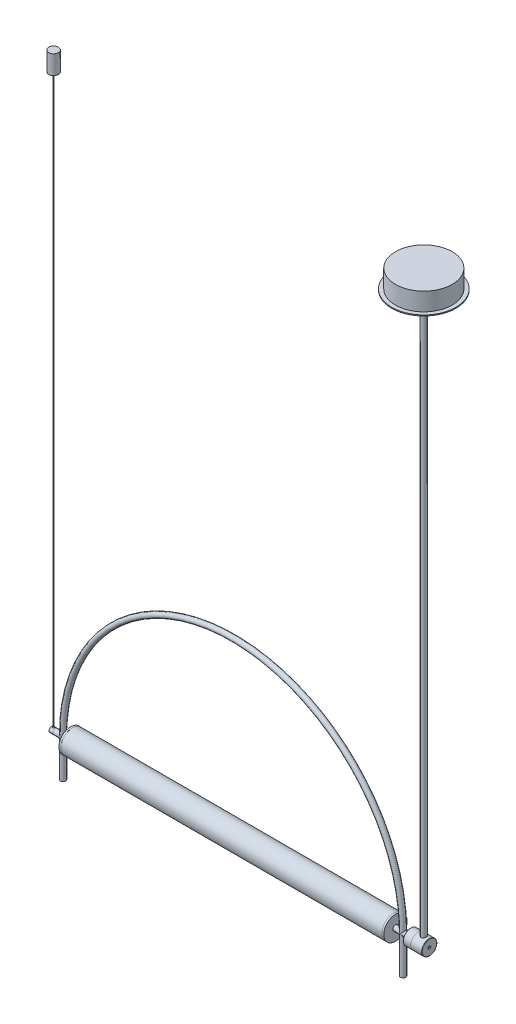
ISO-10303-21;
HEADER;
FILE_DESCRIPTION(('STEP AP214'),'2;1');
FILE_NAME('part.step','',(''),(''),'','','');
FILE_SCHEMA(('AUTOMOTIVE_DESIGN { 1 0 10303 214 1 1 1 1 }'));
ENDSEC;
DATA;
#1=APPLICATION_CONTEXT('core data for automotive mechanical design processes');
#2=APPLICATION_PROTOCOL_DEFINITION('international standard','automotive_design',2000,#1);
#3=PRODUCT_CONTEXT('',#1,'mechanical');
#4=PRODUCT('Part','Part','',(#3));
#5=PRODUCT_RELATED_PRODUCT_CATEGORY('part','',(#4));
#6=PRODUCT_DEFINITION_FORMATION('','',#4);
#7=PRODUCT_DEFINITION_CONTEXT('part definition',#1,'design');
#8=PRODUCT_DEFINITION('design','',#6,#7);
#9=PRODUCT_DEFINITION_SHAPE('','',#8);
#10=(LENGTH_UNIT() NAMED_UNIT(*) SI_UNIT(.MILLI.,.METRE.));
#11=(NAMED_UNIT(*) PLANE_ANGLE_UNIT() SI_UNIT($,.RADIAN.));
#12=(NAMED_UNIT(*) SI_UNIT($,.STERADIAN.) SOLID_ANGLE_UNIT());
#13=UNCERTAINTY_MEASURE_WITH_UNIT(LENGTH_MEASURE(1.E-05),#10,'distance_accuracy_value','');
#14=(GEOMETRIC_REPRESENTATION_CONTEXT(3) GLOBAL_UNCERTAINTY_ASSIGNED_CONTEXT((#13)) GLOBAL_UNIT_ASSIGNED_CONTEXT((#10,
#11,#12)) REPRESENTATION_CONTEXT('',''));
#15=CARTESIAN_POINT('',(0.,0.,0.));
#16=DIRECTION('',(0.,0.,1.));
#17=DIRECTION('',(1.,0.,0.));
#18=AXIS2_PLACEMENT_3D('',#15,#16,#17);
#19=CARTESIAN_POINT('',(-475.,1510.,0.));
#20=DIRECTION('',(0.,-1.,0.));
#21=DIRECTION('',(0.,0.,-1.));
#22=AXIS2_PLACEMENT_3D('',#19,#20,#21);
#23=CYLINDRICAL_SURFACE('',#22,0.999999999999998);
#24=CARTESIAN_POINT('',(-475.,1510.,0.));
#25=DIRECTION('',(0.,1.,0.));
#26=DIRECTION('',(0.,0.,1.));
#27=AXIS2_PLACEMENT_3D('',#24,#25,#26);
#28=CIRCLE('',#27,0.999999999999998);
#29=CARTESIAN_POINT('',(-475.,1510.,0.999999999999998));
#30=VERTEX_POINT('',#29);
#31=EDGE_CURVE('E12',#30,#30,#28,.T.);
#32=ORIENTED_EDGE('',*,*,#31,.F.);
#33=EDGE_LOOP('',(#32));
#34=FACE_BOUND('',#33,.T.);
#35=CARTESIAN_POINT('',(-475.,10.,0.));
#36=DIRECTION('',(0.,1.,0.));
#37=DIRECTION('',(0.,0.,1.));
#38=AXIS2_PLACEMENT_3D('',#35,#36,#37);
#39=CIRCLE('',#38,0.999999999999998);
#40=CARTESIAN_POINT('',(-475.,10.,0.999999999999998));
#41=VERTEX_POINT('',#40);
#42=EDGE_CURVE('E93',#41,#41,#39,.T.);
#43=ORIENTED_EDGE('',*,*,#42,.T.);
#44=EDGE_LOOP('',(#43));
#45=FACE_BOUND('',#44,.T.);
#46=ADVANCED_FACE('F90',(#34,#45),#23,.T.);
#47=CARTESIAN_POINT('',(-475.,10.,0.));
#48=DIRECTION('',(0.,1.,0.));
#49=DIRECTION('',(0.,0.,1.));
#50=AXIS2_PLACEMENT_3D('',#47,#48,#49);
#51=PLANE('',#50);
#52=ORIENTED_EDGE('',*,*,#42,.F.);
#53=EDGE_LOOP('',(#52));
#54=FACE_BOUND('',#53,.T.);
#55=ADVANCED_FACE('F113',(#54),#51,.F.);
#56=CARTESIAN_POINT('',(-475.,1560.038,0.));
#57=DIRECTION('',(0.,-1.,0.));
#58=DIRECTION('',(0.,0.,-1.));
#59=AXIS2_PLACEMENT_3D('',#56,#57,#58);
#60=CYLINDRICAL_SURFACE('',#59,12.7);
#61=CARTESIAN_POINT('',(-475.,1560.038,0.));
#62=DIRECTION('',(0.,1.,0.));
#63=DIRECTION('',(0.,0.,1.));
#64=AXIS2_PLACEMENT_3D('',#61,#62,#63);
#65=CIRCLE('',#64,12.7);
#66=CARTESIAN_POINT('',(-475.,1560.038,12.7));
#67=VERTEX_POINT('',#66);
#68=EDGE_CURVE('E100',#67,#67,#65,.T.);
#69=ORIENTED_EDGE('',*,*,#68,.F.);
#70=EDGE_LOOP('',(#69));
#71=FACE_BOUND('',#70,.T.);
#72=CARTESIAN_POINT('',(-475.,1510.,0.));
#73=DIRECTION('',(0.,1.,0.));
#74=DIRECTION('',(0.,0.,1.));
#75=AXIS2_PLACEMENT_3D('',#72,#73,#74);
#76=CIRCLE('',#75,12.7);
#77=CARTESIAN_POINT('',(-475.,1510.,12.7));
#78=VERTEX_POINT('',#77);
#79=EDGE_CURVE('E102',#78,#78,#76,.T.);
#80=ORIENTED_EDGE('',*,*,#79,.T.);
#81=EDGE_LOOP('',(#80));
#82=FACE_BOUND('',#81,.T.);
#83=ADVANCED_FACE('F110',(#71,#82),#60,.T.);
#84=CARTESIAN_POINT('',(-475.,1560.038,0.));
#85=DIRECTION('',(0.,1.,0.));
#86=DIRECTION('',(0.,0.,1.));
#87=AXIS2_PLACEMENT_3D('',#84,#85,#86);
#88=PLANE('',#87);
#89=ORIENTED_EDGE('',*,*,#68,.T.);
#90=EDGE_LOOP('',(#89));
#91=FACE_BOUND('',#90,.T.);
#92=ADVANCED_FACE('F108',(#91),#88,.T.);
#93=CARTESIAN_POINT('',(-475.,1510.,0.));
#94=DIRECTION('',(0.,1.,0.));
#95=DIRECTION('',(0.,0.,1.));
#96=AXIS2_PLACEMENT_3D('',#93,#94,#95);
#97=PLANE('',#96);
#98=ORIENTED_EDGE('',*,*,#31,.T.);
#99=EDGE_LOOP('',(#98));
#100=FACE_BOUND('',#99,.T.);
#101=ORIENTED_EDGE('',*,*,#79,.F.);
#102=EDGE_LOOP('',(#101));
#103=FACE_BOUND('',#102,.T.);
#104=ADVANCED_FACE('F117',(#100,#103),#97,.F.);
#105=CLOSED_SHELL('',(#46,#55,#83,#92,#104));
#106=MANIFOLD_SOLID_BREP('B2',#105);
#107=CARTESIAN_POINT('',(-480.,0.,0.));
#108=DIRECTION('',(1.,0.,0.));
#109=DIRECTION('',(0.,1.,0.));
#110=AXIS2_PLACEMENT_3D('',#107,#108,#109);
#111=CYLINDRICAL_SURFACE('',#110,7.);
#112=CARTESIAN_POINT('',(-480.,0.,0.));
#113=DIRECTION('',(-1.,0.,0.));
#114=DIRECTION('',(0.,-1.,0.));
#115=AXIS2_PLACEMENT_3D('',#112,#113,#114);
#116=CIRCLE('',#115,7.);
#117=CARTESIAN_POINT('',(-480.,-7.,0.));
#118=VERTEX_POINT('',#117);
#119=EDGE_CURVE('E186',#118,#118,#116,.T.);
#120=ORIENTED_EDGE('',*,*,#119,.F.);
#121=EDGE_LOOP('',(#120));
#122=FACE_BOUND('',#121,.T.);
#123=CARTESIAN_POINT('',(-470.,0.,0.));
#124=DIRECTION('',(-1.,0.,0.));
#125=DIRECTION('',(0.,-1.,0.));
#126=AXIS2_PLACEMENT_3D('',#123,#124,#125);
#127=CIRCLE('',#126,7.);
#128=CARTESIAN_POINT('',(-470.,-7.,0.));
#129=VERTEX_POINT('',#128);
#130=EDGE_CURVE('E190',#129,#129,#127,.T.);
#131=ORIENTED_EDGE('',*,*,#130,.T.);
#132=EDGE_LOOP('',(#131));
#133=FACE_BOUND('',#132,.T.);
#134=CARTESIAN_POINT('',(-477.,7.,0.));
#135=CARTESIAN_POINT('',(-476.999998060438,6.99999869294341,0.10995490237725));
#136=CARTESIAN_POINT('',(-476.990902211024,6.99738417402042,0.219929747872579));
#137=CARTESIAN_POINT('',(-476.954835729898,6.98720905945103,0.436691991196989));
#138=CARTESIAN_POINT('',(-476.927858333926,6.97964659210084,0.543478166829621));
#139=CARTESIAN_POINT('',(-476.856991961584,6.96040691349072,0.750704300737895));
#140=CARTESIAN_POINT('',(-476.813126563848,6.9487354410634,0.851152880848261));
#141=CARTESIAN_POINT('',(-476.709822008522,6.92249978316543,1.0432687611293));
#142=CARTESIAN_POINT('',(-476.65038122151,6.90793529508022,1.13493514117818));
#143=CARTESIAN_POINT('',(-476.515964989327,6.87704734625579,1.30929444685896));
#144=CARTESIAN_POINT('',(-476.440655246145,6.8606904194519,1.39172372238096));
#145=CARTESIAN_POINT('',(-476.277352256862,6.82826734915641,1.54297135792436));
#146=CARTESIAN_POINT('',(-476.189357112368,6.81220124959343,1.61178767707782));
#147=CARTESIAN_POINT('',(-476.001006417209,6.78183014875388,1.7351979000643));
#148=CARTESIAN_POINT('',(-475.900438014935,6.76756702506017,1.78947821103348));
#149=CARTESIAN_POINT('',(-475.691127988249,6.74291343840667,1.8802517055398));
#150=CARTESIAN_POINT('',(-475.582388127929,6.73252214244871,1.91674871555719));
#151=CARTESIAN_POINT('',(-475.362765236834,6.71713608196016,1.96998433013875));
#152=CARTESIAN_POINT('',(-475.252008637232,6.71200978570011,1.98720553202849));
#153=CARTESIAN_POINT('',(-475.029068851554,6.70734208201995,2.00290667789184));
#154=CARTESIAN_POINT('',(-474.91688598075,6.70779946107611,2.00139069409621));
#155=CARTESIAN_POINT('',(-474.698131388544,6.71413034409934,1.98004134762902));
#156=CARTESIAN_POINT('',(-474.591495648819,6.71982782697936,1.9608032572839));
#157=CARTESIAN_POINT('',(-474.383032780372,6.73571348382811,1.90551386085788));
#158=CARTESIAN_POINT('',(-474.28120608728,6.74590206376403,1.86946103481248));
#159=CARTESIAN_POINT('',(-474.083753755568,6.7697686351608,1.78110681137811));
#160=CARTESIAN_POINT('',(-473.988222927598,6.78348916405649,1.7286055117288));
#161=CARTESIAN_POINT('',(-473.807123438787,6.81285216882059,1.60898379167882));
#162=CARTESIAN_POINT('',(-473.721557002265,6.82849507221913,1.54186011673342));
#163=CARTESIAN_POINT('',(-473.559427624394,6.86066250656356,1.39190399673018));
#164=CARTESIAN_POINT('',(-473.483325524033,6.87719804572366,1.30857487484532));
#165=CARTESIAN_POINT('',(-473.34607399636,6.90876247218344,1.13013228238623));
#166=CARTESIAN_POINT('',(-473.284925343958,6.92379128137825,1.03501820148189));
#167=CARTESIAN_POINT('',(-473.179071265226,6.95076528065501,0.834923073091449));
#168=CARTESIAN_POINT('',(-473.134459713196,6.96269275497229,0.72988981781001));
#169=CARTESIAN_POINT('',(-473.063666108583,6.98199251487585,0.513393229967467));
#170=CARTESIAN_POINT('',(-473.037479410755,6.98936594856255,0.401931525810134));
#171=CARTESIAN_POINT('',(-473.005026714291,6.99854874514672,0.179666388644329));
#172=CARTESIAN_POINT('',(-472.998135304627,7.00053272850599,0.0689613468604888));
#173=CARTESIAN_POINT('',(-473.002727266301,6.99922084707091,-0.152026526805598));
#174=CARTESIAN_POINT('',(-473.014208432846,6.99592561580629,-0.262309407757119));
#175=CARTESIAN_POINT('',(-473.054710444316,6.98453926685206,-0.477018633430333));
#176=CARTESIAN_POINT('',(-473.083373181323,6.97654613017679,-0.581518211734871));
#177=CARTESIAN_POINT('',(-473.157000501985,6.95667998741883,-0.784208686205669));
#178=CARTESIAN_POINT('',(-473.201966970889,6.94480653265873,-0.882398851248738));
#179=CARTESIAN_POINT('',(-473.308023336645,6.91809961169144,-1.07204168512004));
#180=CARTESIAN_POINT('',(-473.369441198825,6.90320763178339,-1.1633024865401));
#181=CARTESIAN_POINT('',(-473.506252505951,6.8721794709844,-1.33443852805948));
#182=CARTESIAN_POINT('',(-473.581649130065,6.85604300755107,-1.41431117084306));
#183=CARTESIAN_POINT('',(-473.747209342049,6.82368619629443,-1.56310642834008));
#184=CARTESIAN_POINT('',(-473.837775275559,6.80748036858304,-1.63158542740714));
#185=CARTESIAN_POINT('',(-474.029462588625,6.77738894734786,-1.75239531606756));
#186=CARTESIAN_POINT('',(-474.130583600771,6.76350327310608,-1.80472676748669));
#187=CARTESIAN_POINT('',(-474.340091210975,6.73978651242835,-1.89137454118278));
#188=CARTESIAN_POINT('',(-474.448435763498,6.72993400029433,-1.92578633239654));
#189=CARTESIAN_POINT('',(-474.669709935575,6.71542456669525,-1.9757945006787));
#190=CARTESIAN_POINT('',(-474.782638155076,6.71076607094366,-1.99139657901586));
#191=CARTESIAN_POINT('',(-475.005296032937,6.70731703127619,-2.00298024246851));
#192=CARTESIAN_POINT('',(-475.114985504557,6.70831160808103,-1.99968027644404));
#193=CARTESIAN_POINT('',(-475.332174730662,6.71554597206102,-1.97524710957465));
#194=CARTESIAN_POINT('',(-475.439674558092,6.72178558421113,-1.95411450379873));
#195=CARTESIAN_POINT('',(-475.648378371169,6.73866977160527,-1.89505968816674));
#196=CARTESIAN_POINT('',(-475.749635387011,6.74926877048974,-1.85731091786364));
#197=CARTESIAN_POINT('',(-475.944458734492,6.77367302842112,-1.7662294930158));
#198=CARTESIAN_POINT('',(-476.038023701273,6.78747885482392,-1.7128940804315));
#199=CARTESIAN_POINT('',(-476.218183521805,6.81731668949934,-1.59006546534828));
#200=CARTESIAN_POINT('',(-476.304441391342,6.83340763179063,-1.52009227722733));
#201=CARTESIAN_POINT('',(-476.46422389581,6.86569845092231,-1.36685984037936));
#202=CARTESIAN_POINT('',(-476.537745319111,6.88189835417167,-1.28359725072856));
#203=CARTESIAN_POINT('',(-476.671837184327,6.91307959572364,-1.10357432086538));
#204=CARTESIAN_POINT('',(-476.73202698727,6.92801901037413,-1.00652250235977));
#205=CARTESIAN_POINT('',(-476.835145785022,6.95451395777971,-0.803250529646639));
#206=CARTESIAN_POINT('',(-476.878084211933,6.96607133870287,-0.697035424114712));
#207=CARTESIAN_POINT('',(-476.940847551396,6.98327344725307,-0.492916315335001));
#208=CARTESIAN_POINT('',(-476.962973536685,6.98949684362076,-0.395763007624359));
#209=CARTESIAN_POINT('',(-476.992549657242,6.99786043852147,-0.199078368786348));
#210=CARTESIAN_POINT('',(-477.000001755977,7.00000118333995,-0.099547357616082));
#211=CARTESIAN_POINT('',(-477.,7.,0.));
#212=B_SPLINE_CURVE_WITH_KNOTS('',3,(#134,#135,#136,#137,#138,#139,#140,#141,#142,#143,#144,
#145,#146,#147,#148,#149,#150,#151,#152,#153,#154,#155,#156,#157,#158,#159,#160,#161,#162,#163,
#164,#165,#166,#167,#168,#169,#170,#171,#172,#173,#174,#175,#176,#177,#178,#179,#180,#181,#182,
#183,#184,#185,#186,#187,#188,#189,#190,#191,#192,#193,#194,#195,#196,#197,#198,#199,#200,#201,
#202,#203,#204,#205,#206,#207,#208,#209,#210,#211),.UNSPECIFIED.,.T.,.F.,(4,2,2,2,2,2,2,2,2,2,2,
2,2,2,2,2,2,2,2,2,2,2,2,2,2,2,2,2,2,2,2,2,2,2,2,2,2,2,4),(0.,0.329499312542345,
0.659123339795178,0.988288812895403,1.31748873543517,1.65447811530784,1.99151797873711,
2.33533075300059,2.6790695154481,3.0139950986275,3.34884789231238,3.67284785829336,
3.99687711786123,4.32500803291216,4.65321205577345,4.99378500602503,5.33437560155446,
5.67687101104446,6.01928004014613,6.350454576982,6.68158937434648,7.0060514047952,
7.3305509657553,7.66207525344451,7.99367503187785,8.33612104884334,8.67855514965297,
9.01914573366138,9.35963305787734,9.68726681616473,10.0148896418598,10.3391709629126,
10.6635096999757,10.9986765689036,11.3339278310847,11.6777797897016,12.0214434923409,
12.3197946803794,12.6181059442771),.UNSPECIFIED.);
#213=CARTESIAN_POINT('',(-477.,7.,0.));
#214=VERTEX_POINT('',#213);
#215=EDGE_CURVE('E89',#214,#214,#212,.T.);
#216=ORIENTED_EDGE('',*,*,#215,.F.);
#217=EDGE_LOOP('',(#216));
#218=FACE_BOUND('',#217,.T.);
#219=ADVANCED_FACE('F175',(#122,#133,#218),#111,.T.);
#220=CARTESIAN_POINT('',(-480.,0.,0.));
#221=DIRECTION('',(-1.,0.,0.));
#222=DIRECTION('',(0.,-1.,0.));
#223=AXIS2_PLACEMENT_3D('',#220,#221,#222);
#224=PLANE('',#223);
#225=ORIENTED_EDGE('',*,*,#119,.T.);
#226=EDGE_LOOP('',(#225));
#227=FACE_BOUND('',#226,.T.);
#228=ADVANCED_FACE('F210',(#227),#224,.T.);
#229=CARTESIAN_POINT('',(-470.,0.,0.));
#230=DIRECTION('',(-1.,0.,0.));
#231=DIRECTION('',(0.,-1.,0.));
#232=AXIS2_PLACEMENT_3D('',#229,#230,#231);
#233=PLANE('',#232);
#234=ORIENTED_EDGE('',*,*,#130,.F.);
#235=EDGE_LOOP('',(#234));
#236=FACE_BOUND('',#235,.T.);
#237=ADVANCED_FACE('F204',(#236),#233,.F.);
#238=CARTESIAN_POINT('',(-475.,10.,0.));
#239=DIRECTION('',(0.,-1.,0.));
#240=DIRECTION('',(0.,0.,-1.));
#241=AXIS2_PLACEMENT_3D('',#238,#239,#240);
#242=CYLINDRICAL_SURFACE('',#241,2.);
#243=CARTESIAN_POINT('',(-475.,10.,0.));
#244=DIRECTION('',(0.,1.,0.));
#245=DIRECTION('',(0.,0.,1.));
#246=AXIS2_PLACEMENT_3D('',#243,#244,#245);
#247=CIRCLE('',#246,2.);
#248=CARTESIAN_POINT('',(-475.,10.,2.));
#249=VERTEX_POINT('',#248);
#250=EDGE_CURVE('E195',#249,#249,#247,.T.);
#251=ORIENTED_EDGE('',*,*,#250,.F.);
#252=EDGE_LOOP('',(#251));
#253=FACE_BOUND('',#252,.T.);
#254=ORIENTED_EDGE('',*,*,#215,.T.);
#255=EDGE_LOOP('',(#254));
#256=FACE_BOUND('',#255,.T.);
#257=ADVANCED_FACE('F202',(#253,#256),#242,.T.);
#258=CARTESIAN_POINT('',(-475.,10.,0.));
#259=DIRECTION('',(0.,1.,0.));
#260=DIRECTION('',(0.,0.,1.));
#261=AXIS2_PLACEMENT_3D('',#258,#259,#260);
#262=PLANE('',#261);
#263=ORIENTED_EDGE('',*,*,#250,.T.);
#264=EDGE_LOOP('',(#263));
#265=FACE_BOUND('',#264,.T.);
#266=ADVANCED_FACE('F200',(#265),#262,.T.);
#267=CLOSED_SHELL('',(#219,#228,#237,#257,#266));
#268=MANIFOLD_SOLID_BREP('B7',#267);
#269=CARTESIAN_POINT('',(520.,0.,0.));
#270=DIRECTION('',(-1.,0.,0.));
#271=DIRECTION('',(0.,-1.,0.));
#272=AXIS2_PLACEMENT_3D('',#269,#270,#271);
#273=CYLINDRICAL_SURFACE('',#272,20.);
#274=CARTESIAN_POINT('',(519.,0.,0.));
#275=DIRECTION('',(1.,0.,0.));
#276=DIRECTION('',(0.,1.,0.));
#277=AXIS2_PLACEMENT_3D('',#274,#275,#276);
#278=CIRCLE('',#277,20.);
#279=CARTESIAN_POINT('',(519.,20.,0.));
#280=VERTEX_POINT('',#279);
#281=EDGE_CURVE('E267',#280,#280,#278,.F.);
#282=ORIENTED_EDGE('',*,*,#281,.T.);
#283=EDGE_LOOP('',(#282));
#284=FACE_BOUND('',#283,.T.);
#285=CARTESIAN_POINT('',(490.,0.,0.));
#286=DIRECTION('',(1.,0.,0.));
#287=DIRECTION('',(0.,1.,0.));
#288=AXIS2_PLACEMENT_3D('',#285,#286,#287);
#289=CIRCLE('',#288,20.);
#290=CARTESIAN_POINT('',(490.,20.,0.));
#291=VERTEX_POINT('',#290);
#292=EDGE_CURVE('E291',#291,#291,#289,.T.);
#293=ORIENTED_EDGE('',*,*,#292,.T.);
#294=EDGE_LOOP('',(#293));
#295=FACE_BOUND('',#294,.T.);
#296=CARTESIAN_POINT('',(505.,18.7349939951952,-7.00000000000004));
#297=CARTESIAN_POINT('',(504.810024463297,18.7349936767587,-7.00000037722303));
#298=CARTESIAN_POINT('',(504.620054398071,18.7378913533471,-6.99225993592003));
#299=CARTESIAN_POINT('',(504.24147726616,18.749387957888,-6.96137363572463));
#300=CARTESIAN_POINT('',(504.052870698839,18.7579888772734,-6.93822239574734));
#301=CARTESIAN_POINT('',(503.678544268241,18.7806109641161,-6.87675215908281));
#302=CARTESIAN_POINT('',(503.492823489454,18.7946303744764,-6.83843807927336));
#303=CARTESIAN_POINT('',(503.125447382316,18.8276514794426,-6.74699191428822));
#304=CARTESIAN_POINT('',(502.943793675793,18.8466551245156,-6.69385402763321));
#305=CARTESIAN_POINT('',(502.58630114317,18.889005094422,-6.57339692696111));
#306=CARTESIAN_POINT('',(502.410448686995,18.9123402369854,-6.5061141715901));
#307=CARTESIAN_POINT('',(502.065116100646,18.9627093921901,-6.35781274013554));
#308=CARTESIAN_POINT('',(501.895638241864,18.9897447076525,-6.27678922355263));
#309=CARTESIAN_POINT('',(501.564119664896,19.0467478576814,-6.10162882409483));
#310=CARTESIAN_POINT('',(501.40207901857,19.0767157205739,-6.00749181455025));
#311=CARTESIAN_POINT('',(501.086343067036,19.1387759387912,-5.80674524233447));
#312=CARTESIAN_POINT('',(500.932648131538,19.1708683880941,-5.70013512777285));
#313=CARTESIAN_POINT('',(500.628568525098,19.2376336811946,-5.47067459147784));
#314=CARTESIAN_POINT('',(500.478553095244,19.2723583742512,-5.34734968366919));
#315=CARTESIAN_POINT('',(500.189382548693,19.3422428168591,-5.08876908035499));
#316=CARTESIAN_POINT('',(500.050224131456,19.3774024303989,-4.95351703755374));
#317=CARTESIAN_POINT('',(499.783483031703,19.4472483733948,-4.67178763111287));
#318=CARTESIAN_POINT('',(499.655906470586,19.4819344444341,-4.52530440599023));
#319=CARTESIAN_POINT('',(499.413267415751,19.5498853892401,-4.2220975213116));
#320=CARTESIAN_POINT('',(499.298200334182,19.5831507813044,-4.06537765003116));
#321=CARTESIAN_POINT('',(499.078097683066,19.6483472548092,-3.73780023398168));
#322=CARTESIAN_POINT('',(498.973459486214,19.6802097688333,-3.56666163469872));
#323=CARTESIAN_POINT('',(498.779078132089,19.7406011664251,-3.21564366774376));
#324=CARTESIAN_POINT('',(498.689329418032,19.7691312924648,-3.03576759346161));
#325=CARTESIAN_POINT('',(498.525448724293,19.8220533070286,-2.66845032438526));
#326=CARTESIAN_POINT('',(498.451316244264,19.8464453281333,-2.48100937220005));
#327=CARTESIAN_POINT('',(498.319357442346,19.8903773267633,-2.0999212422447));
#328=CARTESIAN_POINT('',(498.261530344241,19.9099175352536,-1.90627436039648));
#329=CARTESIAN_POINT('',(498.164637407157,19.9429232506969,-1.52171879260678));
#330=CARTESIAN_POINT('',(498.124941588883,19.9565915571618,-1.33098614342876));
#331=CARTESIAN_POINT('',(498.061560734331,19.9785147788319,-0.94657437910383));
#332=CARTESIAN_POINT('',(498.037874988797,19.9867699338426,-0.752895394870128));
#333=CARTESIAN_POINT('',(498.006757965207,19.9976303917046,-0.364123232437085));
#334=CARTESIAN_POINT('',(497.999322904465,20.0002370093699,-0.169030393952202));
#335=CARTESIAN_POINT('',(498.000773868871,19.999729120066,0.221084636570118));
#336=CARTESIAN_POINT('',(498.009659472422,19.9966147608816,0.416106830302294));
#337=CARTESIAN_POINT('',(498.042918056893,19.9850134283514,0.796113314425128));
#338=CARTESIAN_POINT('',(498.066601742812,19.9767656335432,0.9811657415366));
#339=CARTESIAN_POINT('',(498.128605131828,19.9553306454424,1.34857389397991));
#340=CARTESIAN_POINT('',(498.166929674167,19.9421418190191,1.53092870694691));
#341=CARTESIAN_POINT('',(498.257855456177,19.9111699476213,1.89157640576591));
#342=CARTESIAN_POINT('',(498.310452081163,19.8933883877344,2.06987058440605));
#343=CARTESIAN_POINT('',(498.429502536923,19.8536719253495,2.42136493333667));
#344=CARTESIAN_POINT('',(498.495961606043,19.8317354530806,2.59456314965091));
#345=CARTESIAN_POINT('',(498.643176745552,19.7839402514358,2.93700478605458));
#346=CARTESIAN_POINT('',(498.724112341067,19.7580329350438,3.1061641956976));
#347=CARTESIAN_POINT('',(498.899077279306,19.7031560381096,3.43711975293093));
#348=CARTESIAN_POINT('',(498.993111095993,19.67418541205,3.59891335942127));
#349=CARTESIAN_POINT('',(499.193603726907,19.6139006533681,3.91416146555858));
#350=CARTESIAN_POINT('',(499.300063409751,19.5825863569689,4.06761538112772));
#351=CARTESIAN_POINT('',(499.524719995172,19.5183786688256,4.36532799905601));
#352=CARTESIAN_POINT('',(499.642917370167,19.4854852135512,4.50958633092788));
#353=CARTESIAN_POINT('',(499.896751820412,19.4171944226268,4.79533560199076));
#354=CARTESIAN_POINT('',(500.03297500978,19.3817556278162,4.93629648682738));
#355=CARTESIAN_POINT('',(500.316724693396,19.3109865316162,5.2062724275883));
#356=CARTESIAN_POINT('',(500.464247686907,19.2756562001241,5.33529115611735));
#357=CARTESIAN_POINT('',(500.769832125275,19.2060453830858,5.58068993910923));
#358=CARTESIAN_POINT('',(500.927899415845,19.1717654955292,5.69706288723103));
#359=CARTESIAN_POINT('',(501.253485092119,19.1052608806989,5.91625928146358));
#360=CARTESIAN_POINT('',(501.420999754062,19.0730353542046,6.01908801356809));
#361=CARTESIAN_POINT('',(501.767540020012,19.0110293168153,6.21218426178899));
#362=CARTESIAN_POINT('',(501.946716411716,18.9813018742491,6.30219860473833));
#363=CARTESIAN_POINT('',(502.312589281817,18.92589495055,6.46668658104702));
#364=CARTESIAN_POINT('',(502.499282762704,18.9002138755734,6.54116633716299));
#365=CARTESIAN_POINT('',(502.878902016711,18.8537418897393,6.67393200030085));
#366=CARTESIAN_POINT('',(503.071826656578,18.8329500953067,6.73222083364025));
#367=CARTESIAN_POINT('',(503.462475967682,18.7969722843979,6.83203151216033));
#368=CARTESIAN_POINT('',(503.660200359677,18.7817859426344,6.87355433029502));
#369=CARTESIAN_POINT('',(504.049063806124,18.7581577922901,6.93776811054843));
#370=CARTESIAN_POINT('',(504.240048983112,18.7494212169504,6.96128423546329));
#371=CARTESIAN_POINT('',(504.623481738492,18.7377974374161,6.99251229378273));
#372=CARTESIAN_POINT('',(504.815929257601,18.7349099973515,7.00022486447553));
#373=CARTESIAN_POINT('',(505.200766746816,18.7350817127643,6.99976517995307));
#374=CARTESIAN_POINT('',(505.393156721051,18.738139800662,6.99159577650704));
#375=CARTESIAN_POINT('',(505.776427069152,18.7500973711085,6.95946417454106));
#376=CARTESIAN_POINT('',(505.967307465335,18.7589967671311,6.93550220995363));
#377=CARTESIAN_POINT('',(506.33863236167,18.781878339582,6.87328841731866));
#378=CARTESIAN_POINT('',(506.519191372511,18.7956460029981,6.83563802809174));
#379=CARTESIAN_POINT('',(506.876440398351,18.8278880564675,6.74632371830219));
#380=CARTESIAN_POINT('',(507.053129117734,18.8463639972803,6.69465518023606));
#381=CARTESIAN_POINT('',(507.401415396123,18.8874797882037,6.57776107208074));
#382=CARTESIAN_POINT('',(507.573014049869,18.9101187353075,6.51253844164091));
#383=CARTESIAN_POINT('',(507.910199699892,18.9589403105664,6.36901297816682));
#384=CARTESIAN_POINT('',(508.075784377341,18.985124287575,6.29070516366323));
#385=CARTESIAN_POINT('',(508.405412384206,19.041259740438,6.1187318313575));
#386=CARTESIAN_POINT('',(508.569215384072,19.071308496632,6.02463742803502));
#387=CARTESIAN_POINT('',(508.888442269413,19.1336212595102,5.82371023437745));
#388=CARTESIAN_POINT('',(509.04386324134,19.1658860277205,5.71687305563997));
#389=CARTESIAN_POINT('',(509.345420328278,19.2317711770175,5.49115626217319));
#390=CARTESIAN_POINT('',(509.491555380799,19.2653917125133,5.3722752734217));
#391=CARTESIAN_POINT('',(509.773713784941,19.3331213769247,5.12318980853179));
#392=CARTESIAN_POINT('',(509.909736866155,19.3672305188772,4.99298502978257));
#393=CARTESIAN_POINT('',(510.177978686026,19.4369182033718,4.71464591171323));
#394=CARTESIAN_POINT('',(510.309592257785,19.472476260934,4.56592241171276));
#395=CARTESIAN_POINT('',(510.559812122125,19.5421870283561,4.25768503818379));
#396=CARTESIAN_POINT('',(510.678422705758,19.5763401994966,4.09817475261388));
#397=CARTESIAN_POINT('',(510.901894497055,19.6423255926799,3.76924245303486));
#398=CARTESIAN_POINT('',(511.006750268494,19.674156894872,3.59981655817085));
#399=CARTESIAN_POINT('',(511.201808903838,19.734584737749,3.25226947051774));
#400=CARTESIAN_POINT('',(511.292017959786,19.763182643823,3.07415199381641));
#401=CARTESIAN_POINT('',(511.456650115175,19.8162127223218,2.71130074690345));
#402=CARTESIAN_POINT('',(511.531152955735,19.8406658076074,2.52660625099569));
#403=CARTESIAN_POINT('',(511.664262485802,19.884879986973,2.1511080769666));
#404=CARTESIAN_POINT('',(511.722875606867,19.9046429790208,1.96030690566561));
#405=CARTESIAN_POINT('',(511.823669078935,19.9389119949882,1.57397195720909));
#406=CARTESIAN_POINT('',(511.865851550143,19.9534186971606,1.37843879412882));
#407=CARTESIAN_POINT('',(511.933357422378,19.9767474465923,0.984151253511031));
#408=CARTESIAN_POINT('',(511.958681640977,19.9855697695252,0.785397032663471));
#409=CARTESIAN_POINT('',(511.99133924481,19.9969649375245,0.396560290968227));
#410=CARTESIAN_POINT('',(511.999531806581,19.9998361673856,0.206558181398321));
#411=CARTESIAN_POINT('',(512.000429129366,20.0001501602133,-0.173485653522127));
#412=CARTESIAN_POINT('',(511.993134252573,19.9975930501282,-0.363527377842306));
#413=CARTESIAN_POINT('',(511.963130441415,19.987120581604,-0.742219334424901));
#414=CARTESIAN_POINT('',(511.940423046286,19.9792057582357,-0.930869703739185));
#415=CARTESIAN_POINT('',(511.87981575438,19.9582328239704,-1.30542175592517));
#416=CARTESIAN_POINT('',(511.841915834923,19.9451747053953,-1.49132343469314));
#417=CARTESIAN_POINT('',(511.752150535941,19.9145623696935,-1.85552174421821));
#418=CARTESIAN_POINT('',(511.700567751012,19.8970994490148,-2.03389587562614));
#419=CARTESIAN_POINT('',(511.583549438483,19.8579979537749,-2.38563243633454));
#420=CARTESIAN_POINT('',(511.518109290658,19.8363579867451,-2.55899317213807));
#421=CARTESIAN_POINT('',(511.373923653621,19.7894481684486,-2.89953103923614));
#422=CARTESIAN_POINT('',(511.295181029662,19.7641790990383,-3.06670949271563));
#423=CARTESIAN_POINT('',(511.12493111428,19.710612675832,-3.394003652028));
#424=CARTESIAN_POINT('',(511.033418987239,19.682314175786,-3.55411665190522));
#425=CARTESIAN_POINT('',(510.834484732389,19.6222291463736,-3.87238402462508));
#426=CARTESIAN_POINT('',(510.726582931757,19.5903498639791,-4.03022114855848));
#427=CARTESIAN_POINT('',(510.49839390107,19.5248659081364,-4.33637284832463));
#428=CARTESIAN_POINT('',(510.378102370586,19.4912606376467,-4.48468408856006));
#429=CARTESIAN_POINT('',(510.125903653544,19.4231858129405,-4.77090111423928));
#430=CARTESIAN_POINT('',(509.99399485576,19.3887161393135,-4.90880545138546));
#431=CARTESIAN_POINT('',(509.719360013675,19.3198005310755,-5.17339357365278));
#432=CARTESIAN_POINT('',(509.576633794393,19.2853545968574,-5.30007717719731));
#433=CARTESIAN_POINT('',(509.274582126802,19.215865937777,-5.54686012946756));
#434=CARTESIAN_POINT('',(509.114800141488,19.1808651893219,-5.66641328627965));
#435=CARTESIAN_POINT('',(508.785372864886,19.1129036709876,-5.89158249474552));
#436=CARTESIAN_POINT('',(508.615731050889,19.0799421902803,-5.99720341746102));
#437=CARTESIAN_POINT('',(508.267547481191,19.0170330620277,-6.19379640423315));
#438=CARTESIAN_POINT('',(508.089002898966,18.9870863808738,-6.28476377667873));
#439=CARTESIAN_POINT('',(507.724325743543,18.9311782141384,-6.4512171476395));
#440=CARTESIAN_POINT('',(507.538196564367,18.9052149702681,-6.52670998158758));
#441=CARTESIAN_POINT('',(507.161596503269,18.8583660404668,-6.66085801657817));
#442=CARTESIAN_POINT('',(506.971192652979,18.8374293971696,-6.71968339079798));
#443=CARTESIAN_POINT('',(506.58564795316,18.8009966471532,-6.82095488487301));
#444=CARTESIAN_POINT('',(506.390509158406,18.7854982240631,-6.86340797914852));
#445=CARTESIAN_POINT('',(505.99697385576,18.7604745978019,-6.93151590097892));
#446=CARTESIAN_POINT('',(505.798577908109,18.7509483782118,-6.95717358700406));
#447=CARTESIAN_POINT('',(505.400119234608,18.7382083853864,-6.99141505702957));
#448=CARTESIAN_POINT('',(505.200056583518,18.7349943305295,-6.99999960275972));
#449=CARTESIAN_POINT('',(505.,18.7349939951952,-7.00000000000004));
#450=B_SPLINE_CURVE_WITH_KNOTS('',3,(#296,#297,#298,#299,#300,#301,#302,#303,#304,#305,#306,
#307,#308,#309,#310,#311,#312,#313,#314,#315,#316,#317,#318,#319,#320,#321,#322,#323,#324,#325,
#326,#327,#328,#329,#330,#331,#332,#333,#334,#335,#336,#337,#338,#339,#340,#341,#342,#343,#344,
#345,#346,#347,#348,#349,#350,#351,#352,#353,#354,#355,#356,#357,#358,#359,#360,#361,#362,#363,
#364,#365,#366,#367,#368,#369,#370,#371,#372,#373,#374,#375,#376,#377,#378,#379,#380,#381,#382,
#383,#384,#385,#386,#387,#388,#389,#390,#391,#392,#393,#394,#395,#396,#397,#398,#399,#400,#401,
#402,#403,#404,#405,#406,#407,#408,#409,#410,#411,#412,#413,#414,#415,#416,#417,#418,#419,#420,
#421,#422,#423,#424,#425,#426,#427,#428,#429,#430,#431,#432,#433,#434,#435,#436,#437,#438,#439,
#440,#441,#442,#443,#444,#445,#446,#447,#448,#449),.UNSPECIFIED.,.T.,.F.,(4,2,2,2,2,2,2,2,2,2,2,
2,2,2,2,2,2,2,2,2,2,2,2,2,2,2,2,2,2,2,2,2,2,2,2,2,2,2,2,2,2,2,2,2,2,2,2,2,2,2,2,2,2,2,2,2,2,2,2,
2,2,2,2,2,2,2,2,2,2,2,2,2,2,2,2,2,4),(0.,0.569738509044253,1.13967606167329,1.70942895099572,
2.27940513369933,2.84792982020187,3.41665520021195,3.98538607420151,4.55414212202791,
5.14531552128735,5.73630849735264,6.32761203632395,6.91869797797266,7.52726682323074,
8.13560803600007,8.74392975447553,9.3522225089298,9.93737668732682,10.5225049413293,
11.1074969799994,11.6924739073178,12.2520482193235,12.8118076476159,13.3713863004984,
13.9311767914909,14.4984630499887,15.0659435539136,15.6334637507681,16.2010067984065,
16.7979365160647,17.3946820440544,17.9917611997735,18.5886066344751,19.1959655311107,
19.8030845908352,20.4100938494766,21.0170678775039,21.5942138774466,22.1713366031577,
22.7483557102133,23.3253662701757,23.8795990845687,24.4340146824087,24.9883101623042,
25.5428171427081,26.1160255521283,26.6894319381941,27.2629038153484,27.8363910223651,
28.4409422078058,29.0452932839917,29.6498824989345,30.2542154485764,30.8554020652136,
31.4563449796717,32.0572103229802,32.6580465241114,33.2279468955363,33.7978339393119,
34.3676640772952,34.9374950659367,35.4963673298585,36.0554262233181,36.6143648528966,
37.173515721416,37.7543699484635,38.33542647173,38.916563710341,39.4977103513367,
40.1047936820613,40.7116641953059,41.3187286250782,41.9255243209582,42.5258809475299,
43.1259815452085,43.72597998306,44.3259516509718),.UNSPECIFIED.);
#451=CARTESIAN_POINT('',(505.,18.7349939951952,-7.00000000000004));
#452=VERTEX_POINT('',#451);
#453=EDGE_CURVE('E294',#452,#452,#450,.T.);
#454=ORIENTED_EDGE('',*,*,#453,.F.);
#455=EDGE_LOOP('',(#454));
#456=FACE_BOUND('',#455,.T.);
#457=ADVANCED_FACE('F259',(#284,#295,#456),#273,.T.);
#458=CARTESIAN_POINT('',(520.,0.,0.));
#459=DIRECTION('',(1.,0.,0.));
#460=DIRECTION('',(0.,1.,0.));
#461=AXIS2_PLACEMENT_3D('',#458,#459,#460);
#462=PLANE('',#461);
#463=CARTESIAN_POINT('',(520.,0.,0.));
#464=DIRECTION('',(1.,0.,0.));
#465=DIRECTION('',(0.,0.,-1.));
#466=AXIS2_PLACEMENT_3D('',#463,#464,#465);
#467=CIRCLE('',#466,3.5433);
#468=CARTESIAN_POINT('',(520.,0.,-3.5433));
#469=VERTEX_POINT('',#468);
#470=EDGE_CURVE('E279',#469,#469,#467,.T.);
#471=ORIENTED_EDGE('',*,*,#470,.F.);
#472=EDGE_LOOP('',(#471));
#473=FACE_BOUND('',#472,.T.);
#474=CARTESIAN_POINT('',(520.,0.,0.));
#475=DIRECTION('',(1.,0.,0.));
#476=DIRECTION('',(0.,1.,0.));
#477=AXIS2_PLACEMENT_3D('',#474,#475,#476);
#478=CIRCLE('',#477,19.);
#479=CARTESIAN_POINT('',(520.,19.,0.));
#480=VERTEX_POINT('',#479);
#481=EDGE_CURVE('E272',#480,#480,#478,.T.);
#482=ORIENTED_EDGE('',*,*,#481,.T.);
#483=EDGE_LOOP('',(#482));
#484=FACE_BOUND('',#483,.T.);
#485=ADVANCED_FACE('F312',(#473,#484),#462,.T.);
#486=CARTESIAN_POINT('',(490.,0.,0.));
#487=DIRECTION('',(1.,0.,0.));
#488=DIRECTION('',(0.,1.,0.));
#489=AXIS2_PLACEMENT_3D('',#486,#487,#488);
#490=PLANE('',#489);
#491=CARTESIAN_POINT('',(490.,0.,0.));
#492=DIRECTION('',(1.,0.,0.));
#493=DIRECTION('',(0.,1.,0.));
#494=AXIS2_PLACEMENT_3D('',#491,#492,#493);
#495=CIRCLE('',#494,1.89865);
#496=CARTESIAN_POINT('',(490.,1.89864999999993,0.));
#497=VERTEX_POINT('',#496);
#498=EDGE_CURVE('E263',#497,#497,#495,.T.);
#499=ORIENTED_EDGE('',*,*,#498,.T.);
#500=EDGE_LOOP('',(#499));
#501=FACE_BOUND('',#500,.T.);
#502=ORIENTED_EDGE('',*,*,#292,.F.);
#503=EDGE_LOOP('',(#502));
#504=FACE_BOUND('',#503,.T.);
#505=ADVANCED_FACE('F308',(#501,#504),#490,.F.);
#506=CARTESIAN_POINT('',(505.,1500.,0.));
#507=DIRECTION('',(0.,-1.,0.));
#508=DIRECTION('',(0.,0.,-1.));
#509=AXIS2_PLACEMENT_3D('',#506,#507,#508);
#510=CYLINDRICAL_SURFACE('',#509,7.00000000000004);
#511=CARTESIAN_POINT('',(505.,1500.,0.));
#512=DIRECTION('',(0.,1.,0.));
#513=DIRECTION('',(0.,0.,1.));
#514=AXIS2_PLACEMENT_3D('',#511,#512,#513);
#515=CIRCLE('',#514,7.00000000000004);
#516=CARTESIAN_POINT('',(505.,1500.,7.00000000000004));
#517=VERTEX_POINT('',#516);
#518=EDGE_CURVE('E288',#517,#517,#515,.T.);
#519=ORIENTED_EDGE('',*,*,#518,.F.);
#520=EDGE_LOOP('',(#519));
#521=FACE_BOUND('',#520,.T.);
#522=ORIENTED_EDGE('',*,*,#453,.T.);
#523=EDGE_LOOP('',(#522));
#524=FACE_BOUND('',#523,.T.);
#525=ADVANCED_FACE('F303',(#521,#524),#510,.T.);
#526=CARTESIAN_POINT('',(519.,0.,0.));
#527=DIRECTION('',(1.,0.,0.));
#528=DIRECTION('',(0.,1.,0.));
#529=AXIS2_PLACEMENT_3D('',#526,#527,#528);
#530=TOROIDAL_SURFACE('',#529,19.,1.);
#531=ORIENTED_EDGE('',*,*,#281,.F.);
#532=EDGE_LOOP('',(#531));
#533=FACE_BOUND('',#532,.T.);
#534=ORIENTED_EDGE('',*,*,#481,.F.);
#535=EDGE_LOOP('',(#534));
#536=FACE_BOUND('',#535,.T.);
#537=ADVANCED_FACE('F261',(#533,#536),#530,.T.);
#538=CARTESIAN_POINT('',(520.,0.,0.));
#539=DIRECTION('',(1.,0.,0.));
#540=DIRECTION('',(0.,0.,-1.));
#541=AXIS2_PLACEMENT_3D('',#538,#539,#540);
#542=CYLINDRICAL_SURFACE('',#541,1.89865);
#543=CARTESIAN_POINT('',(518.108046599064,0.,0.));
#544=DIRECTION('',(1.,0.,0.));
#545=DIRECTION('',(0.,0.,-1.));
#546=AXIS2_PLACEMENT_3D('',#543,#544,#545);
#547=CIRCLE('',#546,1.89865);
#548=CARTESIAN_POINT('',(518.108046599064,0.,-1.89865));
#549=VERTEX_POINT('',#548);
#550=EDGE_CURVE('E285',#549,#549,#547,.T.);
#551=ORIENTED_EDGE('',*,*,#550,.T.);
#552=EDGE_LOOP('',(#551));
#553=FACE_BOUND('',#552,.T.);
#554=ORIENTED_EDGE('',*,*,#498,.F.);
#555=EDGE_LOOP('',(#554));
#556=FACE_BOUND('',#555,.T.);
#557=ADVANCED_FACE('F310',(#553,#556),#542,.F.);
#558=CARTESIAN_POINT('',(520.,0.,0.));
#559=DIRECTION('',(1.,0.,0.));
#560=DIRECTION('',(0.,0.,-1.));
#561=AXIS2_PLACEMENT_3D('',#558,#559,#560);
#562=CONICAL_SURFACE('',#561,3.5433,0.715584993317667);
#563=ORIENTED_EDGE('',*,*,#550,.F.);
#564=EDGE_LOOP('',(#563));
#565=FACE_BOUND('',#564,.T.);
#566=ORIENTED_EDGE('',*,*,#470,.T.);
#567=EDGE_LOOP('',(#566));
#568=FACE_BOUND('',#567,.T.);
#569=ADVANCED_FACE('F340',(#565,#568),#562,.F.);
#570=CARTESIAN_POINT('',(505.,1502.54,0.));
#571=DIRECTION('',(0.,-1.,0.));
#572=DIRECTION('',(0.,0.,-1.));
#573=AXIS2_PLACEMENT_3D('',#570,#571,#572);
#574=CYLINDRICAL_SURFACE('',#573,84.963);
#575=CARTESIAN_POINT('',(505.,1502.54,0.));
#576=DIRECTION('',(0.,1.,0.));
#577=DIRECTION('',(0.,0.,1.));
#578=AXIS2_PLACEMENT_3D('',#575,#576,#577);
#579=CIRCLE('',#578,84.963);
#580=CARTESIAN_POINT('',(505.,1502.54,84.963));
#581=VERTEX_POINT('',#580);
#582=EDGE_CURVE('E276',#581,#581,#579,.T.);
#583=ORIENTED_EDGE('',*,*,#582,.F.);
#584=EDGE_LOOP('',(#583));
#585=FACE_BOUND('',#584,.T.);
#586=CARTESIAN_POINT('',(505.,1500.,0.));
#587=DIRECTION('',(0.,1.,0.));
#588=DIRECTION('',(0.,0.,1.));
#589=AXIS2_PLACEMENT_3D('',#586,#587,#588);
#590=CIRCLE('',#589,84.963);
#591=CARTESIAN_POINT('',(505.,1500.,84.963));
#592=VERTEX_POINT('',#591);
#593=EDGE_CURVE('E280',#592,#592,#590,.T.);
#594=ORIENTED_EDGE('',*,*,#593,.T.);
#595=EDGE_LOOP('',(#594));
#596=FACE_BOUND('',#595,.T.);
#597=ADVANCED_FACE('F345',(#585,#596),#574,.T.);
#598=CARTESIAN_POINT('',(505.,1502.54,0.));
#599=DIRECTION('',(0.,1.,0.));
#600=DIRECTION('',(0.,0.,1.));
#601=AXIS2_PLACEMENT_3D('',#598,#599,#600);
#602=PLANE('',#601);
#603=CARTESIAN_POINT('',(505.,1502.54,0.));
#604=DIRECTION('',(0.,1.,0.));
#605=DIRECTION('',(0.,0.,1.));
#606=AXIS2_PLACEMENT_3D('',#603,#604,#605);
#607=CIRCLE('',#606,75.057);
#608=CARTESIAN_POINT('',(505.,1502.54,-75.057));
#609=VERTEX_POINT('',#608);
#610=EDGE_CURVE('E174',#609,#609,#607,.T.);
#611=ORIENTED_EDGE('',*,*,#610,.F.);
#612=EDGE_LOOP('',(#611));
#613=FACE_BOUND('',#612,.T.);
#614=ORIENTED_EDGE('',*,*,#582,.T.);
#615=EDGE_LOOP('',(#614));
#616=FACE_BOUND('',#615,.T.);
#617=ADVANCED_FACE('F355',(#613,#616),#602,.T.);
#618=CARTESIAN_POINT('',(505.,1500.,0.));
#619=DIRECTION('',(0.,1.,0.));
#620=DIRECTION('',(0.,0.,1.));
#621=AXIS2_PLACEMENT_3D('',#618,#619,#620);
#622=PLANE('',#621);
#623=ORIENTED_EDGE('',*,*,#518,.T.);
#624=EDGE_LOOP('',(#623));
#625=FACE_BOUND('',#624,.T.);
#626=ORIENTED_EDGE('',*,*,#593,.F.);
#627=EDGE_LOOP('',(#626));
#628=FACE_BOUND('',#627,.T.);
#629=ADVANCED_FACE('F359',(#625,#628),#622,.F.);
#630=CARTESIAN_POINT('',(505.,1550.038,0.));
#631=DIRECTION('',(0.,-1.,0.));
#632=DIRECTION('',(0.,0.,-1.));
#633=AXIS2_PLACEMENT_3D('',#630,#631,#632);
#634=CYLINDRICAL_SURFACE('',#633,75.057);
#635=CARTESIAN_POINT('',(505.,1550.038,0.));
#636=DIRECTION('',(0.,1.,0.));
#637=DIRECTION('',(0.,0.,1.));
#638=AXIS2_PLACEMENT_3D('',#635,#636,#637);
#639=CIRCLE('',#638,75.057);
#640=CARTESIAN_POINT('',(505.,1550.038,-75.057));
#641=VERTEX_POINT('',#640);
#642=EDGE_CURVE('E275',#641,#641,#639,.T.);
#643=CARTESIAN_POINT('',(505.,1550.038,-75.057));
#644=CARTESIAN_POINT('',(505.,1549.54322916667,-75.057));
#645=CARTESIAN_POINT('',(505.,1549.04845833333,-75.057));
#646=CARTESIAN_POINT('',(505.,1548.05891666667,-75.057));
#647=CARTESIAN_POINT('',(505.,1547.56414583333,-75.057));
#648=CARTESIAN_POINT('',(505.,1546.57460416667,-75.057));
#649=CARTESIAN_POINT('',(505.,1546.07983333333,-75.057));
#650=CARTESIAN_POINT('',(505.,1545.09029166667,-75.057));
#651=CARTESIAN_POINT('',(505.,1544.59552083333,-75.057));
#652=CARTESIAN_POINT('',(505.,1543.60597916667,-75.057));
#653=CARTESIAN_POINT('',(505.,1543.11120833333,-75.057));
#654=CARTESIAN_POINT('',(505.,1542.12166666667,-75.057));
#655=CARTESIAN_POINT('',(505.,1541.62689583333,-75.057));
#656=CARTESIAN_POINT('',(505.,1540.63735416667,-75.057));
#657=CARTESIAN_POINT('',(505.,1540.14258333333,-75.057));
#658=CARTESIAN_POINT('',(505.,1539.15304166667,-75.057));
#659=CARTESIAN_POINT('',(505.,1538.65827083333,-75.057));
#660=CARTESIAN_POINT('',(505.,1537.66872916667,-75.057));
#661=CARTESIAN_POINT('',(505.,1537.17395833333,-75.057));
#662=CARTESIAN_POINT('',(505.,1536.18441666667,-75.057));
#663=CARTESIAN_POINT('',(505.,1535.68964583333,-75.057));
#664=CARTESIAN_POINT('',(505.,1534.70010416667,-75.057));
#665=CARTESIAN_POINT('',(505.,1534.20533333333,-75.057));
#666=CARTESIAN_POINT('',(505.,1533.21579166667,-75.057));
#667=CARTESIAN_POINT('',(505.,1532.72102083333,-75.057));
#668=CARTESIAN_POINT('',(505.,1531.73147916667,-75.057));
#669=CARTESIAN_POINT('',(505.,1531.23670833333,-75.057));
#670=CARTESIAN_POINT('',(505.,1530.24716666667,-75.057));
#671=CARTESIAN_POINT('',(505.,1529.75239583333,-75.057));
#672=CARTESIAN_POINT('',(505.,1528.76285416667,-75.057));
#673=CARTESIAN_POINT('',(505.,1528.26808333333,-75.057));
#674=CARTESIAN_POINT('',(505.,1527.27854166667,-75.057));
#675=CARTESIAN_POINT('',(505.,1526.78377083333,-75.057));
#676=CARTESIAN_POINT('',(505.,1525.79422916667,-75.057));
#677=CARTESIAN_POINT('',(505.,1525.29945833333,-75.057));
#678=CARTESIAN_POINT('',(505.,1524.30991666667,-75.057));
#679=CARTESIAN_POINT('',(505.,1523.81514583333,-75.057));
#680=CARTESIAN_POINT('',(505.,1522.82560416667,-75.057));
#681=CARTESIAN_POINT('',(505.,1522.33083333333,-75.057));
#682=CARTESIAN_POINT('',(505.,1521.34129166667,-75.057));
#683=CARTESIAN_POINT('',(505.,1520.84652083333,-75.057));
#684=CARTESIAN_POINT('',(505.,1519.85697916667,-75.057));
#685=CARTESIAN_POINT('',(505.,1519.36220833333,-75.057));
#686=CARTESIAN_POINT('',(505.,1518.37266666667,-75.057));
#687=CARTESIAN_POINT('',(505.,1517.87789583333,-75.057));
#688=CARTESIAN_POINT('',(505.,1516.88835416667,-75.057));
#689=CARTESIAN_POINT('',(505.,1516.39358333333,-75.057));
#690=CARTESIAN_POINT('',(505.,1515.40404166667,-75.057));
#691=CARTESIAN_POINT('',(505.,1514.90927083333,-75.057));
#692=CARTESIAN_POINT('',(505.,1513.91972916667,-75.057));
#693=CARTESIAN_POINT('',(505.,1513.42495833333,-75.057));
#694=CARTESIAN_POINT('',(505.,1512.43541666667,-75.057));
#695=CARTESIAN_POINT('',(505.,1511.94064583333,-75.057));
#696=CARTESIAN_POINT('',(505.,1510.95110416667,-75.057));
#697=CARTESIAN_POINT('',(505.,1510.45633333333,-75.057));
#698=CARTESIAN_POINT('',(505.,1509.46679166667,-75.057));
#699=CARTESIAN_POINT('',(505.,1508.97202083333,-75.057));
#700=CARTESIAN_POINT('',(505.,1507.98247916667,-75.057));
#701=CARTESIAN_POINT('',(505.,1507.48770833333,-75.057));
#702=CARTESIAN_POINT('',(505.,1506.49816666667,-75.057));
#703=CARTESIAN_POINT('',(505.,1506.00339583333,-75.057));
#704=CARTESIAN_POINT('',(505.,1505.01385416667,-75.057));
#705=CARTESIAN_POINT('',(505.,1504.51908333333,-75.057));
#706=CARTESIAN_POINT('',(505.,1503.52954166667,-75.057));
#707=CARTESIAN_POINT('',(505.,1503.03477083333,-75.057));
#708=CARTESIAN_POINT('',(505.,1502.54,-75.057));
#709=B_SPLINE_CURVE_WITH_KNOTS('',3,(#643,#644,#645,#646,#647,#648,#649,#650,#651,#652,#653,
#654,#655,#656,#657,#658,#659,#660,#661,#662,#663,#664,#665,#666,#667,#668,#669,#670,#671,#672,
#673,#674,#675,#676,#677,#678,#679,#680,#681,#682,#683,#684,#685,#686,#687,#688,#689,#690,#691,
#692,#693,#694,#695,#696,#697,#698,#699,#700,#701,#702,#703,#704,#705,#706,#707,#708),
.UNSPECIFIED.,.F.,.F.,(4,2,2,2,2,2,2,2,2,2,2,2,2,2,2,2,2,2,2,2,2,2,2,2,2,2,2,2,2,2,2,2,4),(0.,
1.48431249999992,2.96862499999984,4.45293749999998,5.93724999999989,7.42156249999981,
8.90587499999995,10.3901874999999,11.8744999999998,13.3588124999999,14.8431249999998,16.3274375,
17.8117499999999,19.2960624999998,20.780375,22.2646874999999,23.7489999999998,25.2333124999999,
26.7176249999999,28.2019375,29.6862499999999,31.1705624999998,32.654875,34.1391874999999,
35.6234999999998,37.1078125,38.5921249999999,40.0764375,41.5607499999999,43.0450624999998,
44.529375,46.0136874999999,47.4979999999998),.UNSPECIFIED.);
#710=EDGE_CURVE('BSEAM362',#641,#609,#709,.T.);
#711=ORIENTED_EDGE('',*,*,#642,.F.);
#712=ORIENTED_EDGE('',*,*,#610,.T.);
#713=ORIENTED_EDGE('',*,*,#710,.T.);
#714=ORIENTED_EDGE('',*,*,#710,.F.);
#715=EDGE_LOOP('',(#711,#713,#712,#714));
#716=FACE_BOUND('',#715,.T.);
#717=ADVANCED_FACE('F362',(#716),#634,.T.);
#718=CARTESIAN_POINT('',(505.,1550.038,0.));
#719=DIRECTION('',(0.,1.,0.));
#720=DIRECTION('',(0.,0.,1.));
#721=AXIS2_PLACEMENT_3D('',#718,#719,#720);
#722=PLANE('',#721);
#723=ORIENTED_EDGE('',*,*,#642,.T.);
#724=EDGE_LOOP('',(#723));
#725=FACE_BOUND('',#724,.T.);
#726=ADVANCED_FACE('F369',(#725),#722,.T.);
#727=CLOSED_SHELL('',(#457,#485,#505,#525,#537,#557,#569,#597,#617,#629,#717,#726));
#728=MANIFOLD_SOLID_BREP('B84',#727);
#729=CARTESIAN_POINT('',(490.,0.,0.));
#730=DIRECTION('',(-1.,0.,0.));
#731=DIRECTION('',(0.,-1.,0.));
#732=AXIS2_PLACEMENT_3D('',#729,#730,#731);
#733=CYLINDRICAL_SURFACE('',#732,20.);
#734=CARTESIAN_POINT('',(471.,0.,0.));
#735=DIRECTION('',(1.,0.,0.));
#736=DIRECTION('',(0.,1.,0.));
#737=AXIS2_PLACEMENT_3D('',#734,#735,#736);
#738=CIRCLE('',#737,20.);
#739=CARTESIAN_POINT('',(471.,20.,0.));
#740=VERTEX_POINT('',#739);
#741=EDGE_CURVE('E472',#740,#740,#738,.T.);
#742=ORIENTED_EDGE('',*,*,#741,.T.);
#743=EDGE_LOOP('',(#742));
#744=FACE_BOUND('',#743,.T.);
#745=CARTESIAN_POINT('',(490.,0.,0.));
#746=DIRECTION('',(1.,0.,0.));
#747=DIRECTION('',(0.,1.,0.));
#748=AXIS2_PLACEMENT_3D('',#745,#746,#747);
#749=CIRCLE('',#748,20.);
#750=CARTESIAN_POINT('',(490.,20.,0.));
#751=VERTEX_POINT('',#750);
#752=EDGE_CURVE('E476',#751,#751,#749,.T.);
#753=ORIENTED_EDGE('',*,*,#752,.F.);
#754=EDGE_LOOP('',(#753));
#755=FACE_BOUND('',#754,.T.);
#756=ADVANCED_FACE('F464',(#744,#755),#733,.T.);
#757=CARTESIAN_POINT('',(490.,0.,0.));
#758=DIRECTION('',(1.,0.,0.));
#759=DIRECTION('',(0.,1.,0.));
#760=AXIS2_PLACEMENT_3D('',#757,#758,#759);
#761=PLANE('',#760);
#762=CARTESIAN_POINT('',(490.,0.,0.));
#763=DIRECTION('',(1.,0.,0.));
#764=DIRECTION('',(0.,1.,0.));
#765=AXIS2_PLACEMENT_3D('',#762,#763,#764);
#766=CIRCLE('',#765,1.89865);
#767=CARTESIAN_POINT('',(490.,1.89864999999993,0.));
#768=VERTEX_POINT('',#767);
#769=EDGE_CURVE('E468',#768,#768,#766,.T.);
#770=ORIENTED_EDGE('',*,*,#769,.F.);
#771=EDGE_LOOP('',(#770));
#772=FACE_BOUND('',#771,.T.);
#773=ORIENTED_EDGE('',*,*,#752,.T.);
#774=EDGE_LOOP('',(#773));
#775=FACE_BOUND('',#774,.T.);
#776=ADVANCED_FACE('F491',(#772,#775),#761,.T.);
#777=CARTESIAN_POINT('',(470.,0.,0.));
#778=DIRECTION('',(1.,0.,0.));
#779=DIRECTION('',(0.,1.,0.));
#780=AXIS2_PLACEMENT_3D('',#777,#778,#779);
#781=PLANE('',#780);
#782=CARTESIAN_POINT('',(470.,0.,0.));
#783=DIRECTION('',(1.,0.,0.));
#784=DIRECTION('',(0.,0.,-1.));
#785=AXIS2_PLACEMENT_3D('',#782,#783,#784);
#786=CIRCLE('',#785,1.89864999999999);
#787=CARTESIAN_POINT('',(470.,0.,-1.89864999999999));
#788=VERTEX_POINT('',#787);
#789=EDGE_CURVE('E481',#788,#788,#786,.T.);
#790=ORIENTED_EDGE('',*,*,#789,.T.);
#791=EDGE_LOOP('',(#790));
#792=FACE_BOUND('',#791,.T.);
#793=CARTESIAN_POINT('',(470.,0.,0.));
#794=DIRECTION('',(1.,0.,0.));
#795=DIRECTION('',(0.,1.,0.));
#796=AXIS2_PLACEMENT_3D('',#793,#794,#795);
#797=CIRCLE('',#796,19.);
#798=CARTESIAN_POINT('',(470.,19.,0.));
#799=VERTEX_POINT('',#798);
#800=EDGE_CURVE('E258',#799,#799,#797,.F.);
#801=ORIENTED_EDGE('',*,*,#800,.T.);
#802=EDGE_LOOP('',(#801));
#803=FACE_BOUND('',#802,.T.);
#804=ADVANCED_FACE('F494',(#792,#803),#781,.F.);
#805=CARTESIAN_POINT('',(471.,0.,0.));
#806=DIRECTION('',(1.,0.,0.));
#807=DIRECTION('',(0.,1.,0.));
#808=AXIS2_PLACEMENT_3D('',#805,#806,#807);
#809=TOROIDAL_SURFACE('',#808,19.,1.);
#810=ORIENTED_EDGE('',*,*,#800,.F.);
#811=EDGE_LOOP('',(#810));
#812=FACE_BOUND('',#811,.T.);
#813=ORIENTED_EDGE('',*,*,#741,.F.);
#814=EDGE_LOOP('',(#813));
#815=FACE_BOUND('',#814,.T.);
#816=ADVANCED_FACE('F466',(#812,#815),#809,.T.);
#817=CARTESIAN_POINT('',(520.,0.,0.));
#818=DIRECTION('',(1.,0.,0.));
#819=DIRECTION('',(0.,0.,-1.));
#820=AXIS2_PLACEMENT_3D('',#817,#818,#819);
#821=CYLINDRICAL_SURFACE('',#820,1.89865);
#822=ORIENTED_EDGE('',*,*,#769,.T.);
#823=EDGE_LOOP('',(#822));
#824=FACE_BOUND('',#823,.T.);
#825=ORIENTED_EDGE('',*,*,#789,.F.);
#826=EDGE_LOOP('',(#825));
#827=FACE_BOUND('',#826,.T.);
#828=ADVANCED_FACE('F488',(#824,#827),#821,.F.);
#829=CLOSED_SHELL('',(#756,#776,#804,#816,#828));
#830=MANIFOLD_SOLID_BREP('B169',#829);
#831=CARTESIAN_POINT('',(425.,0.,0.));
#832=DIRECTION('',(-1.,0.,0.));
#833=DIRECTION('',(0.,1.,0.));
#834=AXIS2_PLACEMENT_3D('',#831,#832,#833);
#835=PLANE('',#834);
#836=CARTESIAN_POINT('',(425.,0.,0.));
#837=DIRECTION('',(1.,0.,0.));
#838=DIRECTION('',(0.,1.,0.));
#839=AXIS2_PLACEMENT_3D('',#836,#837,#838);
#840=CIRCLE('',#839,30.);
#841=CARTESIAN_POINT('',(425.,30.,0.));
#842=VERTEX_POINT('',#841);
#843=EDGE_CURVE('E463',#842,#842,#840,.T.);
#844=ORIENTED_EDGE('',*,*,#843,.F.);
#845=EDGE_LOOP('',(#844));
#846=FACE_BOUND('',#845,.T.);
#847=CARTESIAN_POINT('',(425.,0.,0.));
#848=DIRECTION('',(-1.,0.,0.));
#849=DIRECTION('',(0.,-1.,0.));
#850=AXIS2_PLACEMENT_3D('',#847,#848,#849);
#851=CIRCLE('',#850,30.888524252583);
#852=CARTESIAN_POINT('',(425.,-30.8885242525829,0.));
#853=VERTEX_POINT('',#852);
#854=EDGE_CURVE('E564',#853,#853,#851,.T.);
#855=ORIENTED_EDGE('',*,*,#854,.F.);
#856=EDGE_LOOP('',(#855));
#857=FACE_BOUND('',#856,.T.);
#858=ADVANCED_FACE('F549',(#846,#857),#835,.F.);
#859=CARTESIAN_POINT('',(429.,0.,0.));
#860=DIRECTION('',(-1.,0.,0.));
#861=DIRECTION('',(0.,1.,0.));
#862=AXIS2_PLACEMENT_3D('',#859,#860,#861);
#863=PLANE('',#862);
#864=CARTESIAN_POINT('',(429.,0.,0.));
#865=DIRECTION('',(-1.,0.,0.));
#866=DIRECTION('',(0.,-1.,0.));
#867=AXIS2_PLACEMENT_3D('',#864,#865,#866);
#868=CIRCLE('',#867,28.888524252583);
#869=CARTESIAN_POINT('',(429.,-28.8885242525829,0.));
#870=VERTEX_POINT('',#869);
#871=EDGE_CURVE('E560',#870,#870,#868,.T.);
#872=ORIENTED_EDGE('',*,*,#871,.T.);
#873=EDGE_LOOP('',(#872));
#874=FACE_BOUND('',#873,.T.);
#875=CARTESIAN_POINT('',(429.,0.,0.));
#876=DIRECTION('',(1.,0.,0.));
#877=DIRECTION('',(0.,1.,0.));
#878=AXIS2_PLACEMENT_3D('',#875,#876,#877);
#879=CIRCLE('',#878,30.);
#880=CARTESIAN_POINT('',(429.,30.,0.));
#881=VERTEX_POINT('',#880);
#882=EDGE_CURVE('E553',#881,#881,#879,.T.);
#883=ORIENTED_EDGE('',*,*,#882,.T.);
#884=EDGE_LOOP('',(#883));
#885=FACE_BOUND('',#884,.T.);
#886=ADVANCED_FACE('F551',(#874,#885),#863,.F.);
#887=CARTESIAN_POINT('',(425.,0.,0.));
#888=DIRECTION('',(1.,0.,0.));
#889=DIRECTION('',(0.,-1.,0.));
#890=AXIS2_PLACEMENT_3D('',#887,#888,#889);
#891=CYLINDRICAL_SURFACE('',#890,30.);
#892=ORIENTED_EDGE('',*,*,#843,.T.);
#893=EDGE_LOOP('',(#892));
#894=FACE_BOUND('',#893,.T.);
#895=ORIENTED_EDGE('',*,*,#882,.F.);
#896=EDGE_LOOP('',(#895));
#897=FACE_BOUND('',#896,.T.);
#898=ADVANCED_FACE('F582',(#894,#897),#891,.T.);
#899=CARTESIAN_POINT('',(-429.,0.,0.));
#900=DIRECTION('',(1.,0.,0.));
#901=DIRECTION('',(0.,1.,0.));
#902=AXIS2_PLACEMENT_3D('',#899,#900,#901);
#903=PLANE('',#902);
#904=CARTESIAN_POINT('',(-429.,0.,0.));
#905=DIRECTION('',(1.,0.,0.));
#906=DIRECTION('',(0.,1.,0.));
#907=AXIS2_PLACEMENT_3D('',#904,#905,#906);
#908=CIRCLE('',#907,28.888524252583);
#909=CARTESIAN_POINT('',(-429.,28.8885242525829,0.));
#910=VERTEX_POINT('',#909);
#911=EDGE_CURVE('E567',#910,#910,#908,.T.);
#912=ORIENTED_EDGE('',*,*,#911,.T.);
#913=EDGE_LOOP('',(#912));
#914=FACE_BOUND('',#913,.T.);
#915=CARTESIAN_POINT('',(-429.,0.,0.));
#916=DIRECTION('',(1.,0.,0.));
#917=DIRECTION('',(0.,1.,0.));
#918=AXIS2_PLACEMENT_3D('',#915,#916,#917);
#919=CIRCLE('',#918,30.888524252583);
#920=CARTESIAN_POINT('',(-429.,30.8885242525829,0.));
#921=VERTEX_POINT('',#920);
#922=EDGE_CURVE('E568',#921,#921,#919,.T.);
#923=ORIENTED_EDGE('',*,*,#922,.F.);
#924=EDGE_LOOP('',(#923));
#925=FACE_BOUND('',#924,.T.);
#926=ADVANCED_FACE('F574',(#914,#925),#903,.F.);
#927=CARTESIAN_POINT('',(430.002,0.,0.));
#928=DIRECTION('',(-1.,0.,0.));
#929=DIRECTION('',(0.,-1.,0.));
#930=AXIS2_PLACEMENT_3D('',#927,#928,#929);
#931=CYLINDRICAL_SURFACE('',#930,30.888524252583);
#932=ORIENTED_EDGE('',*,*,#854,.T.);
#933=EDGE_LOOP('',(#932));
#934=FACE_BOUND('',#933,.T.);
#935=ORIENTED_EDGE('',*,*,#922,.T.);
#936=EDGE_LOOP('',(#935));
#937=FACE_BOUND('',#936,.T.);
#938=ADVANCED_FACE('F579',(#934,#937),#931,.T.);
#939=CARTESIAN_POINT('',(430.002,0.,0.));
#940=DIRECTION('',(-1.,0.,0.));
#941=DIRECTION('',(0.,-1.,0.));
#942=AXIS2_PLACEMENT_3D('',#939,#940,#941);
#943=CYLINDRICAL_SURFACE('',#942,28.888524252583);
#944=ORIENTED_EDGE('',*,*,#871,.F.);
#945=EDGE_LOOP('',(#944));
#946=FACE_BOUND('',#945,.T.);
#947=ORIENTED_EDGE('',*,*,#911,.F.);
#948=EDGE_LOOP('',(#947));
#949=FACE_BOUND('',#948,.T.);
#950=ADVANCED_FACE('F577',(#946,#949),#943,.F.);
#951=CLOSED_SHELL('',(#858,#886,#898,#926,#938,#950));
#952=MANIFOLD_SOLID_BREP('B253',#951);
#953=CARTESIAN_POINT('',(425.,0.,0.));
#954=DIRECTION('',(1.,0.,0.));
#955=DIRECTION('',(0.,-1.,0.));
#956=AXIS2_PLACEMENT_3D('',#953,#954,#955);
#957=CYLINDRICAL_SURFACE('',#956,31.);
#958=CARTESIAN_POINT('',(425.,0.,0.));
#959=DIRECTION('',(1.,0.,0.));
#960=DIRECTION('',(0.,1.,0.));
#961=AXIS2_PLACEMENT_3D('',#958,#959,#960);
#962=CIRCLE('',#961,31.);
#963=CARTESIAN_POINT('',(425.,31.,0.));
#964=VERTEX_POINT('',#963);
#965=EDGE_CURVE('E548',#964,#964,#962,.T.);
#966=ORIENTED_EDGE('',*,*,#965,.T.);
#967=EDGE_LOOP('',(#966));
#968=FACE_BOUND('',#967,.T.);
#969=CARTESIAN_POINT('',(430.,0.,0.));
#970=DIRECTION('',(1.,0.,0.));
#971=DIRECTION('',(0.,1.,0.));
#972=AXIS2_PLACEMENT_3D('',#969,#970,#971);
#973=CIRCLE('',#972,31.);
#974=CARTESIAN_POINT('',(430.,31.,0.));
#975=VERTEX_POINT('',#974);
#976=EDGE_CURVE('E652',#975,#975,#973,.T.);
#977=ORIENTED_EDGE('',*,*,#976,.F.);
#978=EDGE_LOOP('',(#977));
#979=FACE_BOUND('',#978,.T.);
#980=ADVANCED_FACE('F649',(#968,#979),#957,.T.);
#981=CARTESIAN_POINT('',(425.,0.,0.));
#982=DIRECTION('',(-1.,0.,0.));
#983=DIRECTION('',(0.,1.,0.));
#984=AXIS2_PLACEMENT_3D('',#981,#982,#983);
#985=PLANE('',#984);
#986=CARTESIAN_POINT('',(425.,0.,0.));
#987=DIRECTION('',(1.,0.,0.));
#988=DIRECTION('',(0.,1.,0.));
#989=AXIS2_PLACEMENT_3D('',#986,#987,#988);
#990=CIRCLE('',#989,30.);
#991=CARTESIAN_POINT('',(425.,30.,0.));
#992=VERTEX_POINT('',#991);
#993=EDGE_CURVE('E659',#992,#992,#990,.T.);
#994=ORIENTED_EDGE('',*,*,#993,.T.);
#995=EDGE_LOOP('',(#994));
#996=FACE_BOUND('',#995,.T.);
#997=ORIENTED_EDGE('',*,*,#965,.F.);
#998=EDGE_LOOP('',(#997));
#999=FACE_BOUND('',#998,.T.);
#1000=ADVANCED_FACE('F680',(#996,#999),#985,.T.);
#1001=CARTESIAN_POINT('',(430.,0.,0.));
#1002=DIRECTION('',(-1.,0.,0.));
#1003=DIRECTION('',(0.,1.,0.));
#1004=AXIS2_PLACEMENT_3D('',#1001,#1002,#1003);
#1005=PLANE('',#1004);
#1006=ORIENTED_EDGE('',*,*,#976,.T.);
#1007=EDGE_LOOP('',(#1006));
#1008=FACE_BOUND('',#1007,.T.);
#1009=ADVANCED_FACE('F675',(#1008),#1005,.F.);
#1010=CARTESIAN_POINT('',(425.,0.,0.));
#1011=DIRECTION('',(1.,0.,0.));
#1012=DIRECTION('',(0.,-1.,0.));
#1013=AXIS2_PLACEMENT_3D('',#1010,#1011,#1012);
#1014=CYLINDRICAL_SURFACE('',#1013,30.);
#1015=ORIENTED_EDGE('',*,*,#993,.F.);
#1016=EDGE_LOOP('',(#1015));
#1017=FACE_BOUND('',#1016,.T.);
#1018=CARTESIAN_POINT('',(429.,0.,0.));
#1019=DIRECTION('',(1.,0.,0.));
#1020=DIRECTION('',(0.,1.,0.));
#1021=AXIS2_PLACEMENT_3D('',#1018,#1019,#1020);
#1022=CIRCLE('',#1021,30.);
#1023=CARTESIAN_POINT('',(429.,30.,0.));
#1024=VERTEX_POINT('',#1023);
#1025=EDGE_CURVE('E663',#1024,#1024,#1022,.T.);
#1026=ORIENTED_EDGE('',*,*,#1025,.T.);
#1027=EDGE_LOOP('',(#1026));
#1028=FACE_BOUND('',#1027,.T.);
#1029=ADVANCED_FACE('F667',(#1017,#1028),#1014,.F.);
#1030=CARTESIAN_POINT('',(429.,0.,0.));
#1031=DIRECTION('',(-1.,0.,0.));
#1032=DIRECTION('',(0.,1.,0.));
#1033=AXIS2_PLACEMENT_3D('',#1030,#1031,#1032);
#1034=PLANE('',#1033);
#1035=ORIENTED_EDGE('',*,*,#1025,.F.);
#1036=EDGE_LOOP('',(#1035));
#1037=FACE_BOUND('',#1036,.T.);
#1038=ADVANCED_FACE('F669',(#1037),#1034,.T.);
#1039=CLOSED_SHELL('',(#980,#1000,#1009,#1029,#1038));
#1040=MANIFOLD_SOLID_BREP('B458',#1039);
#1041=CARTESIAN_POINT('',(-425.,0.,0.));
#1042=DIRECTION('',(-1.,0.,0.));
#1043=DIRECTION('',(0.,-1.,0.));
#1044=AXIS2_PLACEMENT_3D('',#1041,#1042,#1043);
#1045=CYLINDRICAL_SURFACE('',#1044,31.);
#1046=CARTESIAN_POINT('',(-425.,0.,0.));
#1047=DIRECTION('',(1.,0.,0.));
#1048=DIRECTION('',(0.,1.,0.));
#1049=AXIS2_PLACEMENT_3D('',#1046,#1047,#1048);
#1050=CIRCLE('',#1049,31.);
#1051=CARTESIAN_POINT('',(-425.,31.,0.));
#1052=VERTEX_POINT('',#1051);
#1053=EDGE_CURVE('E648',#1052,#1052,#1050,.T.);
#1054=ORIENTED_EDGE('',*,*,#1053,.F.);
#1055=EDGE_LOOP('',(#1054));
#1056=FACE_BOUND('',#1055,.T.);
#1057=CARTESIAN_POINT('',(-430.,0.,0.));
#1058=DIRECTION('',(1.,0.,0.));
#1059=DIRECTION('',(0.,1.,0.));
#1060=AXIS2_PLACEMENT_3D('',#1057,#1058,#1059);
#1061=CIRCLE('',#1060,31.);
#1062=CARTESIAN_POINT('',(-430.,31.,0.));
#1063=VERTEX_POINT('',#1062);
#1064=EDGE_CURVE('E732',#1063,#1063,#1061,.T.);
#1065=ORIENTED_EDGE('',*,*,#1064,.T.);
#1066=EDGE_LOOP('',(#1065));
#1067=FACE_BOUND('',#1066,.T.);
#1068=ADVANCED_FACE('F729',(#1056,#1067),#1045,.T.);
#1069=CARTESIAN_POINT('',(-425.,0.,0.));
#1070=DIRECTION('',(1.,0.,0.));
#1071=DIRECTION('',(0.,1.,0.));
#1072=AXIS2_PLACEMENT_3D('',#1069,#1070,#1071);
#1073=PLANE('',#1072);
#1074=CARTESIAN_POINT('',(-425.,0.,0.));
#1075=DIRECTION('',(1.,0.,0.));
#1076=DIRECTION('',(0.,1.,0.));
#1077=AXIS2_PLACEMENT_3D('',#1074,#1075,#1076);
#1078=CIRCLE('',#1077,30.);
#1079=CARTESIAN_POINT('',(-425.,30.,0.));
#1080=VERTEX_POINT('',#1079);
#1081=EDGE_CURVE('E739',#1080,#1080,#1078,.T.);
#1082=ORIENTED_EDGE('',*,*,#1081,.F.);
#1083=EDGE_LOOP('',(#1082));
#1084=FACE_BOUND('',#1083,.T.);
#1085=ORIENTED_EDGE('',*,*,#1053,.T.);
#1086=EDGE_LOOP('',(#1085));
#1087=FACE_BOUND('',#1086,.T.);
#1088=ADVANCED_FACE('F759',(#1084,#1087),#1073,.T.);
#1089=CARTESIAN_POINT('',(-430.,0.,0.));
#1090=DIRECTION('',(1.,0.,0.));
#1091=DIRECTION('',(0.,1.,0.));
#1092=AXIS2_PLACEMENT_3D('',#1089,#1090,#1091);
#1093=PLANE('',#1092);
#1094=ORIENTED_EDGE('',*,*,#1064,.F.);
#1095=EDGE_LOOP('',(#1094));
#1096=FACE_BOUND('',#1095,.T.);
#1097=ADVANCED_FACE('F751',(#1096),#1093,.F.);
#1098=CARTESIAN_POINT('',(-425.,0.,0.));
#1099=DIRECTION('',(-1.,0.,0.));
#1100=DIRECTION('',(0.,-1.,0.));
#1101=AXIS2_PLACEMENT_3D('',#1098,#1099,#1100);
#1102=CYLINDRICAL_SURFACE('',#1101,30.);
#1103=ORIENTED_EDGE('',*,*,#1081,.T.);
#1104=EDGE_LOOP('',(#1103));
#1105=FACE_BOUND('',#1104,.T.);
#1106=CARTESIAN_POINT('',(-429.,0.,0.));
#1107=DIRECTION('',(1.,0.,0.));
#1108=DIRECTION('',(0.,1.,0.));
#1109=AXIS2_PLACEMENT_3D('',#1106,#1107,#1108);
#1110=CIRCLE('',#1109,30.);
#1111=CARTESIAN_POINT('',(-429.,30.,0.));
#1112=VERTEX_POINT('',#1111);
#1113=EDGE_CURVE('E743',#1112,#1112,#1110,.T.);
#1114=ORIENTED_EDGE('',*,*,#1113,.F.);
#1115=EDGE_LOOP('',(#1114));
#1116=FACE_BOUND('',#1115,.T.);
#1117=ADVANCED_FACE('F749',(#1105,#1116),#1102,.F.);
#1118=CARTESIAN_POINT('',(-429.,0.,0.));
#1119=DIRECTION('',(1.,0.,0.));
#1120=DIRECTION('',(0.,1.,0.));
#1121=AXIS2_PLACEMENT_3D('',#1118,#1119,#1120);
#1122=PLANE('',#1121);
#1123=ORIENTED_EDGE('',*,*,#1113,.T.);
#1124=EDGE_LOOP('',(#1123));
#1125=FACE_BOUND('',#1124,.T.);
#1126=ADVANCED_FACE('F747',(#1125),#1122,.T.);
#1127=CLOSED_SHELL('',(#1068,#1088,#1097,#1117,#1126));
#1128=MANIFOLD_SOLID_BREP('B543',#1127);
#1129=CARTESIAN_POINT('',(0.,0.,0.));
#1130=DIRECTION('',(0.,0.,-1.));
#1131=DIRECTION('',(-1.,0.,0.));
#1132=AXIS2_PLACEMENT_3D('',#1129,#1130,#1131);
#1133=TOROIDAL_SURFACE('',#1132,450.,7.00000000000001);
#1134=CARTESIAN_POINT('',(-450.,0.,-7.0000000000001));
#1135=CARTESIAN_POINT('',(-449.996055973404,0.00394402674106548,-6.99999999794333));
#1136=CARTESIAN_POINT('',(-449.992111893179,0.00788805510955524,-6.99999666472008));
#1137=CARTESIAN_POINT('',(-449.71821411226,0.281778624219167,-6.9995338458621));
#1138=CARTESIAN_POINT('',(-449.448024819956,0.551717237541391,-6.98347142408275));
#1139=CARTESIAN_POINT('',(-448.909091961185,1.08966650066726,-6.91997633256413));
#1140=CARTESIAN_POINT('',(-448.640349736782,1.35767541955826,-6.87251836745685));
#1141=CARTESIAN_POINT('',(-448.105817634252,1.89027530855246,-6.74551439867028));
#1142=CARTESIAN_POINT('',(-447.840035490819,2.15485753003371,-6.665898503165));
#1143=CARTESIAN_POINT('',(-447.314403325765,2.67765950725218,-6.47361363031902));
#1144=CARTESIAN_POINT('',(-447.05455004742,2.93588276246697,-6.36096329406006));
#1145=CARTESIAN_POINT('',(-446.620027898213,3.36731420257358,-6.14011709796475));
#1146=CARTESIAN_POINT('',(-446.44315520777,3.54282170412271,-6.04069189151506));
#1147=CARTESIAN_POINT('',(-446.094768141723,3.88832017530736,-5.82430412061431));
#1148=CARTESIAN_POINT('',(-445.923253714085,4.05831119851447,-5.70734172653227));
#1149=CARTESIAN_POINT('',(-445.587305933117,4.39108993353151,-5.45543663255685));
#1150=CARTESIAN_POINT('',(-445.422859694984,4.55389076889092,-5.32052866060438));
#1151=CARTESIAN_POINT('',(-445.102492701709,4.870885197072,-5.03193954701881));
#1152=CARTESIAN_POINT('',(-444.94656936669,5.02508139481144,-4.87826413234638));
#1153=CARTESIAN_POINT('',(-444.574103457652,5.39323946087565,-4.47424739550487));
#1154=CARTESIAN_POINT('',(-444.3636370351,5.60110663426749,-4.21248892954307));
#1155=CARTESIAN_POINT('',(-443.97433662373,5.98536256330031,-3.64586535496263));
#1156=CARTESIAN_POINT('',(-443.795462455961,6.16179130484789,-3.34105589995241));
#1157=CARTESIAN_POINT('',(-443.512726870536,6.44052988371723,-2.75706779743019));
#1158=CARTESIAN_POINT('',(-443.401003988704,6.55062078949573,-2.4855108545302));
#1159=CARTESIAN_POINT('',(-443.258372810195,6.69113021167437,-2.06179623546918));
#1160=CARTESIAN_POINT('',(-443.214981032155,6.73386899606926,-1.91779413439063));
#1161=CARTESIAN_POINT('',(-443.137241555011,6.81042962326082,-1.62508251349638));
#1162=CARTESIAN_POINT('',(-443.102889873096,6.84425539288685,-1.4763750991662));
#1163=CARTESIAN_POINT('',(-443.043673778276,6.9025600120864,-1.17410929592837));
#1164=CARTESIAN_POINT('',(-443.018880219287,6.92696905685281,-1.02052348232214));
#1165=CARTESIAN_POINT('',(-442.979667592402,6.96557165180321,-0.710751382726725));
#1166=CARTESIAN_POINT('',(-442.96524854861,6.97976517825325,-0.554565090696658));
#1167=CARTESIAN_POINT('',(-442.947119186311,6.99761076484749,-0.241023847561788));
#1168=CARTESIAN_POINT('',(-442.943405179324,7.00126645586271,-0.0836693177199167));
#1169=CARTESIAN_POINT('',(-442.946763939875,6.99796035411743,0.230804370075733));
#1170=CARTESIAN_POINT('',(-442.953835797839,6.99099945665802,0.387923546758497));
#1171=CARTESIAN_POINT('',(-442.977224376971,6.96797644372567,0.683192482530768));
#1172=CARTESIAN_POINT('',(-442.992432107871,6.95300607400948,0.821518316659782));
#1173=CARTESIAN_POINT('',(-443.03097668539,6.9150600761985,1.09596473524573));
#1174=CARTESIAN_POINT('',(-443.054316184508,6.89208183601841,1.23208458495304));
#1175=CARTESIAN_POINT('',(-443.108722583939,6.83851189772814,1.50119105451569));
#1176=CARTESIAN_POINT('',(-443.139787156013,6.80792249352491,1.63417860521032));
#1177=CARTESIAN_POINT('',(-443.20917806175,6.7395840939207,1.89641132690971));
#1178=CARTESIAN_POINT('',(-443.24750726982,6.7018322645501,2.02565499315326));
#1179=CARTESIAN_POINT('',(-443.33274712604,6.61786357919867,2.28546296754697));
#1180=CARTESIAN_POINT('',(-443.379964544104,6.57134400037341,2.41582853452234));
#1181=CARTESIAN_POINT('',(-443.481099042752,6.47168594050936,2.67134847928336));
#1182=CARTESIAN_POINT('',(-443.53501827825,6.41854533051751,2.79650116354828));
#1183=CARTESIAN_POINT('',(-443.705851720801,6.25014459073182,3.1635638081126));
#1184=CARTESIAN_POINT('',(-443.831869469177,6.12587816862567,3.39716118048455));
#1185=CARTESIAN_POINT('',(-444.179107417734,5.78329424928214,3.9643965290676));
#1186=CARTESIAN_POINT('',(-444.41424207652,5.55115997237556,4.28122555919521));
#1187=CARTESIAN_POINT('',(-444.791193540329,5.17867805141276,4.71356695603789));
#1188=CARTESIAN_POINT('',(-444.921123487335,5.05023524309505,4.85072379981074));
#1189=CARTESIAN_POINT('',(-445.187819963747,4.78646963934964,5.11116543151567));
#1190=CARTESIAN_POINT('',(-445.324586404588,4.65114693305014,5.23445039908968));
#1191=CARTESIAN_POINT('',(-445.657965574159,4.32112806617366,5.51279285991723));
#1192=CARTESIAN_POINT('',(-445.857187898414,4.12378812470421,5.6615887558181));
#1193=CARTESIAN_POINT('',(-446.263929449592,3.72060742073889,5.93433546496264));
#1194=CARTESIAN_POINT('',(-446.471452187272,3.51476305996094,6.0582756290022));
#1195=CARTESIAN_POINT('',(-446.892775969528,3.09654574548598,6.28233196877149));
#1196=CARTESIAN_POINT('',(-447.106578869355,2.88417086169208,6.38244102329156));
#1197=CARTESIAN_POINT('',(-447.538676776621,2.45464388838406,6.55962438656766));
#1198=CARTESIAN_POINT('',(-447.756970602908,2.23749305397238,6.63670467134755));
#1199=CARTESIAN_POINT('',(-448.30778745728,1.68915226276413,6.80185269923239));
#1200=CARTESIAN_POINT('',(-448.642356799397,1.35572077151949,6.87583119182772));
#1201=CARTESIAN_POINT('',(-449.314145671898,0.685456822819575,6.97456933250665));
#1202=CARTESIAN_POINT('',(-449.651359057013,0.348631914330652,6.99942100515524));
#1203=CARTESIAN_POINT('',(-449.99211189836,0.00788805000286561,6.99999666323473));
#1204=CARTESIAN_POINT('',(-449.996055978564,0.00394402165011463,6.99999999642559));
#1205=CARTESIAN_POINT('',(-450.,0.,7.0000000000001));
#1206=B_SPLINE_CURVE_WITH_KNOTS('',3,(#1134,#1135,#1136,#1137,#1138,#1139,#1140,#1141,#1142,
#1143,#1144,#1145,#1146,#1147,#1148,#1149,#1150,#1151,#1152,#1153,#1154,#1155,#1156,#1157,#1158,
#1159,#1160,#1161,#1162,#1163,#1164,#1165,#1166,#1167,#1168,#1169,#1170,#1171,#1172,#1173,#1174,
#1175,#1176,#1177,#1178,#1179,#1180,#1181,#1182,#1183,#1184,#1185,#1186,#1187,#1188,#1189,#1190,
#1191,#1192,#1193,#1194,#1195,#1196,#1197,#1198,#1199,#1200,#1201,#1202,#1203,#1204,#1205),
.UNSPECIFIED.,.F.,.F.,(4,2,2,2,2,2,2,2,2,2,2,2,2,2,2,2,2,2,2,2,2,2,2,2,2,2,2,2,2,2,2,2,2,2,2,4),
(0.,0.0167332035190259,1.16202729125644,2.30824526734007,3.45696794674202,4.60504365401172,
5.4092705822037,6.21348969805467,7.01617455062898,7.81861506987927,8.99935480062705,
10.1785818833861,11.1152807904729,11.5838398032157,12.05219203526,12.5239522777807,
12.9957136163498,13.4673123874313,13.9388713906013,14.3582758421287,14.7778172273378,
15.197232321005,15.6168137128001,16.0551312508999,16.4935900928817,17.3702357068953,
18.7354913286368,19.4204155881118,20.1053309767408,21.0563097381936,22.0076950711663,
22.9593643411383,23.9107864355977,25.3423993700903,26.7713280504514,26.7880612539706),.UNSPECIFIED.);
#1207=CARTESIAN_POINT('',(-450.,0.,-7.00000000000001));
#1208=VERTEX_POINT('',#1207);
#1209=CARTESIAN_POINT('',(-450.,0.,7.));
#1210=VERTEX_POINT('',#1209);
#1211=EDGE_CURVE('E894',#1208,#1210,#1206,.T.);
#1212=ORIENTED_EDGE('',*,*,#1211,.F.);
#1213=CARTESIAN_POINT('',(-450.,0.,7.0000000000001));
#1214=CARTESIAN_POINT('',(-450.003944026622,0.00394402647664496,6.99999999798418));
#1215=CARTESIAN_POINT('',(-450.007888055,0.00788810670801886,6.99999666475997));
#1216=CARTESIAN_POINT('',(-450.279596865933,0.27960407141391,6.9995375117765));
#1217=CARTESIAN_POINT('',(-450.54735434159,0.547608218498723,6.98372861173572));
#1218=CARTESIAN_POINT('',(-451.08097635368,1.08219551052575,6.92108134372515));
#1219=CARTESIAN_POINT('',(-451.346839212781,1.34877735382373,6.87421827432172));
#1220=CARTESIAN_POINT('',(-451.875162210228,1.87899145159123,6.74861215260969));
#1221=CARTESIAN_POINT('',(-452.137614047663,2.14261635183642,6.66980248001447));
#1222=CARTESIAN_POINT('',(-452.656186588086,2.66395124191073,6.47922440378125));
#1223=CARTESIAN_POINT('',(-452.912310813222,2.92166451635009,6.36747480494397));
#1224=CARTESIAN_POINT('',(-453.339355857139,3.35171192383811,6.14860180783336));
#1225=CARTESIAN_POINT('',(-453.512595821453,3.52627275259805,6.05032094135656));
#1226=CARTESIAN_POINT('',(-453.853605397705,3.87007342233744,5.83639699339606));
#1227=CARTESIAN_POINT('',(-454.021375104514,4.03931335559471,5.72075421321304));
#1228=CARTESIAN_POINT('',(-454.349759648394,4.3707524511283,5.4716893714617));
#1229=CARTESIAN_POINT('',(-454.510388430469,4.53296531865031,5.33830419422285));
#1230=CARTESIAN_POINT('',(-454.823176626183,4.84899720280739,5.05297961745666));
#1231=CARTESIAN_POINT('',(-454.975335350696,5.00281553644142,4.90103871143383));
#1232=CARTESIAN_POINT('',(-455.341685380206,5.37333623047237,4.4982717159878));
#1233=CARTESIAN_POINT('',(-455.549595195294,5.58377455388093,4.23555586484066));
#1234=CARTESIAN_POINT('',(-455.837427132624,5.87527850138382,3.80929869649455));
#1235=CARTESIAN_POINT('',(-455.929356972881,5.96841209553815,3.66186682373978));
#1236=CARTESIAN_POINT('',(-456.104030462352,6.1454211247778,3.35632701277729));
#1237=CARTESIAN_POINT('',(-456.18677617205,6.2292986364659,3.19822148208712));
#1238=CARTESIAN_POINT('',(-456.326227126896,6.37069078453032,2.90436514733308));
#1239=CARTESIAN_POINT('',(-456.384835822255,6.43012817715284,2.77043740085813));
#1240=CARTESIAN_POINT('',(-456.494505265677,6.54136703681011,2.49646984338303));
#1241=CARTESIAN_POINT('',(-456.545567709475,6.59317021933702,2.35643141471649));
#1242=CARTESIAN_POINT('',(-456.639391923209,6.68836894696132,2.07083832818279));
#1243=CARTESIAN_POINT('',(-456.682155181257,6.73176599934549,1.92528466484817));
#1244=CARTESIAN_POINT('',(-456.758659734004,6.80941308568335,1.62949648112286));
#1245=CARTESIAN_POINT('',(-456.792404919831,6.84366706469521,1.4792640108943));
#1246=CARTESIAN_POINT('',(-456.850465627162,6.90260788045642,1.17402191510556));
#1247=CARTESIAN_POINT('',(-456.874714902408,6.9272275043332,1.01898659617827));
#1248=CARTESIAN_POINT('',(-456.912952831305,6.9660512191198,0.706355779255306));
#1249=CARTESIAN_POINT('',(-456.926941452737,6.98025527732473,0.548760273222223));
#1250=CARTESIAN_POINT('',(-456.944350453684,6.99793259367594,0.232433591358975));
#1251=CARTESIAN_POINT('',(-456.947774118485,7.00140918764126,0.0737027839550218));
#1252=CARTESIAN_POINT('',(-456.94398460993,6.99756118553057,-0.243492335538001));
#1253=CARTESIAN_POINT('',(-456.936772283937,6.99023744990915,-0.40195666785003));
#1254=CARTESIAN_POINT('',(-456.913189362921,6.96629166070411,-0.700572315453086));
#1255=CARTESIAN_POINT('',(-456.897863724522,6.95073055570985,-0.840894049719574));
#1256=CARTESIAN_POINT('',(-456.859091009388,6.91136518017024,-1.1192849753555));
#1257=CARTESIAN_POINT('',(-456.835641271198,6.88755820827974,-1.25735341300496));
#1258=CARTESIAN_POINT('',(-456.781010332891,6.83210072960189,-1.53029050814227));
#1259=CARTESIAN_POINT('',(-456.749831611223,6.8004527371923,-1.66516017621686));
#1260=CARTESIAN_POINT('',(-456.680193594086,6.72977556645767,-1.93107703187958));
#1261=CARTESIAN_POINT('',(-456.641731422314,6.69074347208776,-2.06212268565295));
#1262=CARTESIAN_POINT('',(-456.556231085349,6.60398915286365,-2.32537309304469));
#1263=CARTESIAN_POINT('',(-456.508892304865,6.55596242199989,-2.45737963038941));
#1264=CARTESIAN_POINT('',(-456.407477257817,6.45309191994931,-2.71606266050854));
#1265=CARTESIAN_POINT('',(-456.353398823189,6.39824595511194,-2.84273742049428));
#1266=CARTESIAN_POINT('',(-456.182008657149,6.2244577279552,-3.21415857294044));
#1267=CARTESIAN_POINT('',(-456.055513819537,6.09623646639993,-3.45038690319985));
#1268=CARTESIAN_POINT('',(-455.709874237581,5.74605121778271,-4.01821621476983));
#1269=CARTESIAN_POINT('',(-455.477324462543,5.51059092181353,-4.33338701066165));
#1270=CARTESIAN_POINT('',(-455.104289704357,5.1332208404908,-4.76304756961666));
#1271=CARTESIAN_POINT('',(-454.975680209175,5.00316898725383,-4.89927189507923));
#1272=CARTESIAN_POINT('',(-454.711596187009,4.73624258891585,-5.15775858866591));
#1273=CARTESIAN_POINT('',(-454.576121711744,4.5993680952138,-5.28002106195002));
#1274=CARTESIAN_POINT('',(-454.247357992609,4.2673622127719,-5.5544508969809));
#1275=CARTESIAN_POINT('',(-454.051521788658,4.06971608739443,-5.70052328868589));
#1276=CARTESIAN_POINT('',(-453.651507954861,3.66627847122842,-5.96799796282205));
#1277=CARTESIAN_POINT('',(-453.44732687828,3.46048361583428,-6.08938992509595));
#1278=CARTESIAN_POINT('',(-453.032575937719,3.04274650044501,-6.30851304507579));
#1279=CARTESIAN_POINT('',(-452.822004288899,2.83080252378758,-6.40623752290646));
#1280=CARTESIAN_POINT('',(-452.39620587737,2.40253526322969,-6.57883758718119));
#1281=CARTESIAN_POINT('',(-452.180980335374,2.18621312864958,-6.65371908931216));
#1282=CARTESIAN_POINT('',(-451.643360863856,1.64624746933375,-6.81194381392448));
#1283=CARTESIAN_POINT('',(-451.318935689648,1.32075029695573,-6.88220993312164));
#1284=CARTESIAN_POINT('',(-450.666939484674,0.667315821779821,-6.97591380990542));
#1285=CARTESIAN_POINT('',(-450.339375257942,0.339384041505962,-6.99943660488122));
#1286=CARTESIAN_POINT('',(-450.007888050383,0.00788810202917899,-6.99999666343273));
#1287=CARTESIAN_POINT('',(-450.00394402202,0.00394402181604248,-6.99999999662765));
#1288=CARTESIAN_POINT('',(-450.,0.,-7.0000000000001));
#1289=B_SPLINE_CURVE_WITH_KNOTS('',3,(#1213,#1214,#1215,#1216,#1217,#1218,#1219,#1220,#1221,
#1222,#1223,#1224,#1225,#1226,#1227,#1228,#1229,#1230,#1231,#1232,#1233,#1234,#1235,#1236,#1237,
#1238,#1239,#1240,#1241,#1242,#1243,#1244,#1245,#1246,#1247,#1248,#1249,#1250,#1251,#1252,#1253,
#1254,#1255,#1256,#1257,#1258,#1259,#1260,#1261,#1262,#1263,#1264,#1265,#1266,#1267,#1268,#1269,
#1270,#1271,#1272,#1273,#1274,#1275,#1276,#1277,#1278,#1279,#1280,#1281,#1282,#1283,#1284,#1285,
#1286,#1287,#1288),.UNSPECIFIED.,.F.,.F.,(4,2,2,2,2,2,2,2,2,2,2,2,2,2,2,2,2,2,2,2,2,2,2,2,2,2,2,
2,2,2,2,2,2,2,2,2,2,4),(0.,0.0167332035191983,1.15277077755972,2.28971307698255,
3.42903861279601,4.56771498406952,5.36164953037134,6.15557030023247,6.94786567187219,
7.74022541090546,8.92214920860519,9.51298285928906,10.1036836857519,10.5766821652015,
11.0495741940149,11.5223813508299,11.9949841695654,12.4708276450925,12.9466726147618,
13.4223696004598,13.898028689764,14.3235732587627,14.7492573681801,15.1748051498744,
15.6005213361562,16.0447838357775,16.4891896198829,17.3777215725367,18.7407140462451,
19.4244435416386,20.108167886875,21.0495692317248,21.9913634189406,22.9334231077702,
23.8752386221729,25.2674296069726,26.6570855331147,26.673818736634),.UNSPECIFIED.);
#1290=EDGE_CURVE('E901',#1210,#1208,#1289,.T.);
#1291=ORIENTED_EDGE('',*,*,#1290,.F.);
#1292=EDGE_LOOP('',(#1212,#1291));
#1293=FACE_BOUND('',#1292,.T.);
#1294=CARTESIAN_POINT('',(450.,0.,7.0000000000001));
#1295=CARTESIAN_POINT('',(449.996055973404,0.00394402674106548,6.99999999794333));
#1296=CARTESIAN_POINT('',(449.992111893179,0.00788805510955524,6.99999666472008));
#1297=CARTESIAN_POINT('',(449.71821411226,0.281778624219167,6.9995338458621));
#1298=CARTESIAN_POINT('',(449.448024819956,0.551717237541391,6.98347142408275));
#1299=CARTESIAN_POINT('',(448.909091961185,1.08966650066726,6.91997633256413));
#1300=CARTESIAN_POINT('',(448.640349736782,1.35767541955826,6.87251836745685));
#1301=CARTESIAN_POINT('',(448.105817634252,1.89027530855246,6.74551439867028));
#1302=CARTESIAN_POINT('',(447.840035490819,2.15485753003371,6.665898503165));
#1303=CARTESIAN_POINT('',(447.314403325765,2.67765950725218,6.47361363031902));
#1304=CARTESIAN_POINT('',(447.05455004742,2.93588276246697,6.36096329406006));
#1305=CARTESIAN_POINT('',(446.620027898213,3.36731420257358,6.14011709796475));
#1306=CARTESIAN_POINT('',(446.44315520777,3.54282170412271,6.04069189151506));
#1307=CARTESIAN_POINT('',(446.094768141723,3.88832017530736,5.82430412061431));
#1308=CARTESIAN_POINT('',(445.923253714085,4.05831119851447,5.70734172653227));
#1309=CARTESIAN_POINT('',(445.587305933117,4.39108993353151,5.45543663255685));
#1310=CARTESIAN_POINT('',(445.422859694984,4.55389076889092,5.32052866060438));
#1311=CARTESIAN_POINT('',(445.102492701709,4.870885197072,5.03193954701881));
#1312=CARTESIAN_POINT('',(444.94656936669,5.02508139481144,4.87826413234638));
#1313=CARTESIAN_POINT('',(444.574103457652,5.39323946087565,4.47424739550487));
#1314=CARTESIAN_POINT('',(444.3636370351,5.60110663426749,4.21248892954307));
#1315=CARTESIAN_POINT('',(443.97433662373,5.98536256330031,3.64586535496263));
#1316=CARTESIAN_POINT('',(443.795462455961,6.16179130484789,3.34105589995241));
#1317=CARTESIAN_POINT('',(443.512726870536,6.44052988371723,2.75706779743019));
#1318=CARTESIAN_POINT('',(443.401003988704,6.55062078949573,2.4855108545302));
#1319=CARTESIAN_POINT('',(443.258372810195,6.69113021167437,2.06179623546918));
#1320=CARTESIAN_POINT('',(443.214981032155,6.73386899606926,1.91779413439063));
#1321=CARTESIAN_POINT('',(443.137241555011,6.81042962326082,1.62508251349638));
#1322=CARTESIAN_POINT('',(443.102889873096,6.84425539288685,1.4763750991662));
#1323=CARTESIAN_POINT('',(443.043673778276,6.9025600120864,1.17410929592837));
#1324=CARTESIAN_POINT('',(443.018880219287,6.92696905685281,1.02052348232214));
#1325=CARTESIAN_POINT('',(442.979667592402,6.96557165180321,0.710751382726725));
#1326=CARTESIAN_POINT('',(442.96524854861,6.97976517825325,0.554565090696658));
#1327=CARTESIAN_POINT('',(442.947119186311,6.99761076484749,0.241023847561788));
#1328=CARTESIAN_POINT('',(442.943405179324,7.00126645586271,0.0836693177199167));
#1329=CARTESIAN_POINT('',(442.946763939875,6.99796035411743,-0.230804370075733));
#1330=CARTESIAN_POINT('',(442.953835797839,6.99099945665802,-0.387923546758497));
#1331=CARTESIAN_POINT('',(442.977224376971,6.96797644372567,-0.683192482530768));
#1332=CARTESIAN_POINT('',(442.992432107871,6.95300607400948,-0.821518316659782));
#1333=CARTESIAN_POINT('',(443.03097668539,6.9150600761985,-1.09596473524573));
#1334=CARTESIAN_POINT('',(443.054316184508,6.89208183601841,-1.23208458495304));
#1335=CARTESIAN_POINT('',(443.108722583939,6.83851189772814,-1.50119105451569));
#1336=CARTESIAN_POINT('',(443.139787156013,6.80792249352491,-1.63417860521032));
#1337=CARTESIAN_POINT('',(443.20917806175,6.7395840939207,-1.89641132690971));
#1338=CARTESIAN_POINT('',(443.24750726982,6.7018322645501,-2.02565499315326));
#1339=CARTESIAN_POINT('',(443.33274712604,6.61786357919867,-2.28546296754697));
#1340=CARTESIAN_POINT('',(443.379964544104,6.57134400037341,-2.41582853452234));
#1341=CARTESIAN_POINT('',(443.481099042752,6.47168594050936,-2.67134847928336));
#1342=CARTESIAN_POINT('',(443.53501827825,6.41854533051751,-2.79650116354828));
#1343=CARTESIAN_POINT('',(443.705851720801,6.25014459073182,-3.1635638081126));
#1344=CARTESIAN_POINT('',(443.831869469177,6.12587816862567,-3.39716118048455));
#1345=CARTESIAN_POINT('',(444.179107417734,5.78329424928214,-3.9643965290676));
#1346=CARTESIAN_POINT('',(444.41424207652,5.55115997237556,-4.28122555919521));
#1347=CARTESIAN_POINT('',(444.791193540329,5.17867805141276,-4.71356695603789));
#1348=CARTESIAN_POINT('',(444.921123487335,5.05023524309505,-4.85072379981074));
#1349=CARTESIAN_POINT('',(445.187819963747,4.78646963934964,-5.11116543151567));
#1350=CARTESIAN_POINT('',(445.324586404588,4.65114693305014,-5.23445039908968));
#1351=CARTESIAN_POINT('',(445.657965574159,4.32112806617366,-5.51279285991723));
#1352=CARTESIAN_POINT('',(445.857187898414,4.12378812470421,-5.6615887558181));
#1353=CARTESIAN_POINT('',(446.263929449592,3.72060742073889,-5.93433546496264));
#1354=CARTESIAN_POINT('',(446.471452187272,3.51476305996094,-6.0582756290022));
#1355=CARTESIAN_POINT('',(446.892775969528,3.09654574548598,-6.28233196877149));
#1356=CARTESIAN_POINT('',(447.106578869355,2.88417086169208,-6.38244102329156));
#1357=CARTESIAN_POINT('',(447.538676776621,2.45464388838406,-6.55962438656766));
#1358=CARTESIAN_POINT('',(447.756970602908,2.23749305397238,-6.63670467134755));
#1359=CARTESIAN_POINT('',(448.30778745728,1.68915226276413,-6.80185269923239));
#1360=CARTESIAN_POINT('',(448.642356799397,1.35572077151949,-6.87583119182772));
#1361=CARTESIAN_POINT('',(449.314145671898,0.685456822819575,-6.97456933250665));
#1362=CARTESIAN_POINT('',(449.651359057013,0.348631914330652,-6.99942100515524));
#1363=CARTESIAN_POINT('',(449.99211189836,0.00788805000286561,-6.99999666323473));
#1364=CARTESIAN_POINT('',(449.996055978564,0.00394402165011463,-6.99999999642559));
#1365=CARTESIAN_POINT('',(450.,0.,-7.0000000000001));
#1366=B_SPLINE_CURVE_WITH_KNOTS('',3,(#1294,#1295,#1296,#1297,#1298,#1299,#1300,#1301,#1302,
#1303,#1304,#1305,#1306,#1307,#1308,#1309,#1310,#1311,#1312,#1313,#1314,#1315,#1316,#1317,#1318,
#1319,#1320,#1321,#1322,#1323,#1324,#1325,#1326,#1327,#1328,#1329,#1330,#1331,#1332,#1333,#1334,
#1335,#1336,#1337,#1338,#1339,#1340,#1341,#1342,#1343,#1344,#1345,#1346,#1347,#1348,#1349,#1350,
#1351,#1352,#1353,#1354,#1355,#1356,#1357,#1358,#1359,#1360,#1361,#1362,#1363,#1364,#1365),
.UNSPECIFIED.,.F.,.F.,(4,2,2,2,2,2,2,2,2,2,2,2,2,2,2,2,2,2,2,2,2,2,2,2,2,2,2,2,2,2,2,2,2,2,2,4),
(0.,0.0167332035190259,1.16202729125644,2.30824526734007,3.45696794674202,4.60504365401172,
5.4092705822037,6.21348969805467,7.01617455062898,7.81861506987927,8.99935480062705,
10.1785818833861,11.1152807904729,11.5838398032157,12.05219203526,12.5239522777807,
12.9957136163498,13.4673123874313,13.9388713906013,14.3582758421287,14.7778172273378,
15.197232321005,15.6168137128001,16.0551312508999,16.4935900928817,17.3702357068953,
18.7354913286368,19.4204155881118,20.1053309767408,21.0563097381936,22.0076950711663,
22.9593643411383,23.9107864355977,25.3423993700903,26.7713280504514,26.7880612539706),.UNSPECIFIED.);
#1367=CARTESIAN_POINT('',(450.,0.,7.));
#1368=VERTEX_POINT('',#1367);
#1369=CARTESIAN_POINT('',(450.,0.,-7.));
#1370=VERTEX_POINT('',#1369);
#1371=EDGE_CURVE('E850',#1368,#1370,#1366,.T.);
#1372=ORIENTED_EDGE('',*,*,#1371,.F.);
#1373=CARTESIAN_POINT('',(450.,0.,-7.0000000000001));
#1374=CARTESIAN_POINT('',(450.003944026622,0.00394402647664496,-6.99999999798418));
#1375=CARTESIAN_POINT('',(450.007888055,0.00788810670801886,-6.99999666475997));
#1376=CARTESIAN_POINT('',(450.279596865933,0.27960407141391,-6.9995375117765));
#1377=CARTESIAN_POINT('',(450.54735434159,0.547608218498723,-6.98372861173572));
#1378=CARTESIAN_POINT('',(451.08097635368,1.08219551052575,-6.92108134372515));
#1379=CARTESIAN_POINT('',(451.346839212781,1.34877735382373,-6.87421827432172));
#1380=CARTESIAN_POINT('',(451.875162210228,1.87899145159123,-6.74861215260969));
#1381=CARTESIAN_POINT('',(452.137614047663,2.14261635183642,-6.66980248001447));
#1382=CARTESIAN_POINT('',(452.656186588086,2.66395124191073,-6.47922440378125));
#1383=CARTESIAN_POINT('',(452.912310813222,2.92166451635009,-6.36747480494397));
#1384=CARTESIAN_POINT('',(453.339355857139,3.35171192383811,-6.14860180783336));
#1385=CARTESIAN_POINT('',(453.512595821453,3.52627275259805,-6.05032094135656));
#1386=CARTESIAN_POINT('',(453.853605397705,3.87007342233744,-5.83639699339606));
#1387=CARTESIAN_POINT('',(454.021375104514,4.03931335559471,-5.72075421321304));
#1388=CARTESIAN_POINT('',(454.349759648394,4.3707524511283,-5.4716893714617));
#1389=CARTESIAN_POINT('',(454.510388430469,4.53296531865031,-5.33830419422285));
#1390=CARTESIAN_POINT('',(454.823176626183,4.84899720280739,-5.05297961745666));
#1391=CARTESIAN_POINT('',(454.975335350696,5.00281553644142,-4.90103871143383));
#1392=CARTESIAN_POINT('',(455.341685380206,5.37333623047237,-4.4982717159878));
#1393=CARTESIAN_POINT('',(455.549595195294,5.58377455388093,-4.23555586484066));
#1394=CARTESIAN_POINT('',(455.837427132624,5.87527850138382,-3.80929869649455));
#1395=CARTESIAN_POINT('',(455.929356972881,5.96841209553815,-3.66186682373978));
#1396=CARTESIAN_POINT('',(456.104030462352,6.1454211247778,-3.35632701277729));
#1397=CARTESIAN_POINT('',(456.18677617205,6.2292986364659,-3.19822148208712));
#1398=CARTESIAN_POINT('',(456.326227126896,6.37069078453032,-2.90436514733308));
#1399=CARTESIAN_POINT('',(456.384835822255,6.43012817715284,-2.77043740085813));
#1400=CARTESIAN_POINT('',(456.494505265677,6.54136703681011,-2.49646984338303));
#1401=CARTESIAN_POINT('',(456.545567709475,6.59317021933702,-2.35643141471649));
#1402=CARTESIAN_POINT('',(456.639391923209,6.68836894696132,-2.07083832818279));
#1403=CARTESIAN_POINT('',(456.682155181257,6.73176599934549,-1.92528466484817));
#1404=CARTESIAN_POINT('',(456.758659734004,6.80941308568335,-1.62949648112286));
#1405=CARTESIAN_POINT('',(456.792404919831,6.84366706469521,-1.4792640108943));
#1406=CARTESIAN_POINT('',(456.850465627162,6.90260788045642,-1.17402191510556));
#1407=CARTESIAN_POINT('',(456.874714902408,6.9272275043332,-1.01898659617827));
#1408=CARTESIAN_POINT('',(456.912952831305,6.9660512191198,-0.706355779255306));
#1409=CARTESIAN_POINT('',(456.926941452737,6.98025527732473,-0.548760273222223));
#1410=CARTESIAN_POINT('',(456.944350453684,6.99793259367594,-0.232433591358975));
#1411=CARTESIAN_POINT('',(456.947774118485,7.00140918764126,-0.0737027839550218));
#1412=CARTESIAN_POINT('',(456.94398460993,6.99756118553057,0.243492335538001));
#1413=CARTESIAN_POINT('',(456.936772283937,6.99023744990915,0.40195666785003));
#1414=CARTESIAN_POINT('',(456.913189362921,6.96629166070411,0.700572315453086));
#1415=CARTESIAN_POINT('',(456.897863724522,6.95073055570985,0.840894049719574));
#1416=CARTESIAN_POINT('',(456.859091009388,6.91136518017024,1.1192849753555));
#1417=CARTESIAN_POINT('',(456.835641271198,6.88755820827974,1.25735341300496));
#1418=CARTESIAN_POINT('',(456.781010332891,6.83210072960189,1.53029050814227));
#1419=CARTESIAN_POINT('',(456.749831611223,6.8004527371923,1.66516017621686));
#1420=CARTESIAN_POINT('',(456.680193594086,6.72977556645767,1.93107703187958));
#1421=CARTESIAN_POINT('',(456.641731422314,6.69074347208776,2.06212268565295));
#1422=CARTESIAN_POINT('',(456.556231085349,6.60398915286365,2.32537309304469));
#1423=CARTESIAN_POINT('',(456.508892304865,6.55596242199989,2.45737963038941));
#1424=CARTESIAN_POINT('',(456.407477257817,6.45309191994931,2.71606266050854));
#1425=CARTESIAN_POINT('',(456.353398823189,6.39824595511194,2.84273742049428));
#1426=CARTESIAN_POINT('',(456.182008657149,6.2244577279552,3.21415857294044));
#1427=CARTESIAN_POINT('',(456.055513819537,6.09623646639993,3.45038690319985));
#1428=CARTESIAN_POINT('',(455.709874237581,5.74605121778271,4.01821621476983));
#1429=CARTESIAN_POINT('',(455.477324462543,5.51059092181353,4.33338701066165));
#1430=CARTESIAN_POINT('',(455.104289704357,5.1332208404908,4.76304756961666));
#1431=CARTESIAN_POINT('',(454.975680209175,5.00316898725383,4.89927189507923));
#1432=CARTESIAN_POINT('',(454.711596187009,4.73624258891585,5.15775858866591));
#1433=CARTESIAN_POINT('',(454.576121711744,4.5993680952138,5.28002106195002));
#1434=CARTESIAN_POINT('',(454.247357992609,4.2673622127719,5.5544508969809));
#1435=CARTESIAN_POINT('',(454.051521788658,4.06971608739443,5.70052328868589));
#1436=CARTESIAN_POINT('',(453.651507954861,3.66627847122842,5.96799796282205));
#1437=CARTESIAN_POINT('',(453.44732687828,3.46048361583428,6.08938992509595));
#1438=CARTESIAN_POINT('',(453.032575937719,3.04274650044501,6.30851304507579));
#1439=CARTESIAN_POINT('',(452.822004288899,2.83080252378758,6.40623752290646));
#1440=CARTESIAN_POINT('',(452.39620587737,2.40253526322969,6.57883758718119));
#1441=CARTESIAN_POINT('',(452.180980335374,2.18621312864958,6.65371908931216));
#1442=CARTESIAN_POINT('',(451.643360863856,1.64624746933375,6.81194381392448));
#1443=CARTESIAN_POINT('',(451.318935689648,1.32075029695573,6.88220993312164));
#1444=CARTESIAN_POINT('',(450.666939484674,0.667315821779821,6.97591380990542));
#1445=CARTESIAN_POINT('',(450.339375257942,0.339384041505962,6.99943660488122));
#1446=CARTESIAN_POINT('',(450.007888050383,0.00788810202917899,6.99999666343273));
#1447=CARTESIAN_POINT('',(450.00394402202,0.00394402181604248,6.99999999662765));
#1448=CARTESIAN_POINT('',(450.,0.,7.0000000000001));
#1449=B_SPLINE_CURVE_WITH_KNOTS('',3,(#1373,#1374,#1375,#1376,#1377,#1378,#1379,#1380,#1381,
#1382,#1383,#1384,#1385,#1386,#1387,#1388,#1389,#1390,#1391,#1392,#1393,#1394,#1395,#1396,#1397,
#1398,#1399,#1400,#1401,#1402,#1403,#1404,#1405,#1406,#1407,#1408,#1409,#1410,#1411,#1412,#1413,
#1414,#1415,#1416,#1417,#1418,#1419,#1420,#1421,#1422,#1423,#1424,#1425,#1426,#1427,#1428,#1429,
#1430,#1431,#1432,#1433,#1434,#1435,#1436,#1437,#1438,#1439,#1440,#1441,#1442,#1443,#1444,#1445,
#1446,#1447,#1448),.UNSPECIFIED.,.F.,.F.,(4,2,2,2,2,2,2,2,2,2,2,2,2,2,2,2,2,2,2,2,2,2,2,2,2,2,2,
2,2,2,2,2,2,2,2,2,2,4),(0.,0.0167332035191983,1.15277077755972,2.28971307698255,
3.42903861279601,4.56771498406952,5.36164953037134,6.15557030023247,6.94786567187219,
7.74022541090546,8.92214920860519,9.51298285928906,10.1036836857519,10.5766821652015,
11.0495741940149,11.5223813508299,11.9949841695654,12.4708276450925,12.9466726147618,
13.4223696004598,13.898028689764,14.3235732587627,14.7492573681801,15.1748051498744,
15.6005213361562,16.0447838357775,16.4891896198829,17.3777215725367,18.7407140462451,
19.4244435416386,20.108167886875,21.0495692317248,21.9913634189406,22.9334231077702,
23.8752386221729,25.2674296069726,26.6570855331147,26.673818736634),.UNSPECIFIED.);
#1450=EDGE_CURVE('E814',#1370,#1368,#1449,.T.);
#1451=ORIENTED_EDGE('',*,*,#1450,.F.);
#1452=EDGE_LOOP('',(#1372,#1451));
#1453=FACE_BOUND('',#1452,.T.);
#1454=ADVANCED_FACE('F800',(#1293,#1453),#1133,.T.);
#1455=CARTESIAN_POINT('',(-470.,0.,0.));
#1456=DIRECTION('',(1.,0.,0.));
#1457=DIRECTION('',(0.,1.,0.));
#1458=AXIS2_PLACEMENT_3D('',#1455,#1456,#1457);
#1459=PLANE('',#1458);
#1460=CARTESIAN_POINT('',(-470.,0.,0.));
#1461=DIRECTION('',(1.,0.,0.));
#1462=DIRECTION('',(0.,1.,0.));
#1463=AXIS2_PLACEMENT_3D('',#1460,#1461,#1462);
#1464=CIRCLE('',#1463,7.);
#1465=CARTESIAN_POINT('',(-470.,7.,0.));
#1466=VERTEX_POINT('',#1465);
#1467=EDGE_CURVE('E912',#1466,#1466,#1464,.T.);
#1468=ORIENTED_EDGE('',*,*,#1467,.F.);
#1469=EDGE_LOOP('',(#1468));
#1470=FACE_BOUND('',#1469,.T.);
#1471=ADVANCED_FACE('F935',(#1470),#1459,.F.);
#1472=CARTESIAN_POINT('',(-450.,0.,0.));
#1473=DIRECTION('',(-1.,0.,0.));
#1474=DIRECTION('',(0.,-1.,0.));
#1475=AXIS2_PLACEMENT_3D('',#1472,#1473,#1474);
#1476=CYLINDRICAL_SURFACE('',#1475,7.);
#1477=ORIENTED_EDGE('',*,*,#1467,.T.);
#1478=EDGE_LOOP('',(#1477));
#1479=FACE_BOUND('',#1478,.T.);
#1480=ORIENTED_EDGE('',*,*,#1290,.T.);
#1481=CARTESIAN_POINT('',(-450.,0.,0.));
#1482=DIRECTION('',(-0.707106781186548,0.707106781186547,0.));
#1483=DIRECTION('',(0.707106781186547,0.707106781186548,0.));
#1484=AXIS2_PLACEMENT_3D('',#1481,#1482,#1483);
#1485=ELLIPSE('',#1484,9.89949493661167,7.);
#1486=EDGE_CURVE('E914',#1208,#1210,#1485,.T.);
#1487=ORIENTED_EDGE('',*,*,#1486,.T.);
#1488=EDGE_LOOP('',(#1480,#1487));
#1489=FACE_BOUND('',#1488,.T.);
#1490=ADVANCED_FACE('F889',(#1479,#1489),#1476,.T.);
#1491=CARTESIAN_POINT('',(-430.,0.,0.));
#1492=DIRECTION('',(-1.,0.,0.));
#1493=DIRECTION('',(0.,0.,1.));
#1494=AXIS2_PLACEMENT_3D('',#1491,#1492,#1493);
#1495=CYLINDRICAL_SURFACE('',#1494,7.);
#1496=CARTESIAN_POINT('',(-430.,0.,0.));
#1497=DIRECTION('',(1.,0.,0.));
#1498=DIRECTION('',(0.,1.,0.));
#1499=AXIS2_PLACEMENT_3D('',#1496,#1497,#1498);
#1500=CIRCLE('',#1499,7.);
#1501=CARTESIAN_POINT('',(-430.,6.99999999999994,0.));
#1502=VERTEX_POINT('',#1501);
#1503=EDGE_CURVE('E910',#1502,#1502,#1500,.T.);
#1504=ORIENTED_EDGE('',*,*,#1503,.F.);
#1505=EDGE_LOOP('',(#1504));
#1506=FACE_BOUND('',#1505,.T.);
#1507=ORIENTED_EDGE('',*,*,#1211,.T.);
#1508=CARTESIAN_POINT('',(-450.,0.,0.));
#1509=DIRECTION('',(0.707106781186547,0.707106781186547,0.));
#1510=DIRECTION('',(-0.707106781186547,0.707106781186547,0.));
#1511=AXIS2_PLACEMENT_3D('',#1508,#1509,#1510);
#1512=ELLIPSE('',#1511,9.89949493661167,7.);
#1513=EDGE_CURVE('E918',#1210,#1208,#1512,.T.);
#1514=ORIENTED_EDGE('',*,*,#1513,.T.);
#1515=EDGE_LOOP('',(#1507,#1514));
#1516=FACE_BOUND('',#1515,.T.);
#1517=ADVANCED_FACE('F884',(#1506,#1516),#1495,.T.);
#1518=CARTESIAN_POINT('',(-430.,0.,0.));
#1519=DIRECTION('',(1.,0.,0.));
#1520=DIRECTION('',(0.,1.,0.));
#1521=AXIS2_PLACEMENT_3D('',#1518,#1519,#1520);
#1522=PLANE('',#1521);
#1523=ORIENTED_EDGE('',*,*,#1503,.T.);
#1524=EDGE_LOOP('',(#1523));
#1525=FACE_BOUND('',#1524,.T.);
#1526=ADVANCED_FACE('F888',(#1525),#1522,.T.);
#1527=CARTESIAN_POINT('',(-450.,-100.,0.));
#1528=DIRECTION('',(0.,-1.,0.));
#1529=DIRECTION('',(0.,0.,1.));
#1530=AXIS2_PLACEMENT_3D('',#1527,#1528,#1529);
#1531=PLANE('',#1530);
#1532=CARTESIAN_POINT('',(-450.,-100.,0.));
#1533=DIRECTION('',(0.,-1.,0.));
#1534=DIRECTION('',(0.,0.,1.));
#1535=AXIS2_PLACEMENT_3D('',#1532,#1533,#1534);
#1536=CIRCLE('',#1535,7.00000000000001);
#1537=CARTESIAN_POINT('',(-450.,-100.,7.00000000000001));
#1538=VERTEX_POINT('',#1537);
#1539=EDGE_CURVE('E921',#1538,#1538,#1536,.T.);
#1540=ORIENTED_EDGE('',*,*,#1539,.T.);
#1541=EDGE_LOOP('',(#1540));
#1542=FACE_BOUND('',#1541,.T.);
#1543=ADVANCED_FACE('F802',(#1542),#1531,.T.);
#1544=CARTESIAN_POINT('',(-450.,-100.,0.));
#1545=DIRECTION('',(0.,1.,0.));
#1546=DIRECTION('',(0.,0.,1.));
#1547=AXIS2_PLACEMENT_3D('',#1544,#1545,#1546);
#1548=CYLINDRICAL_SURFACE('',#1547,7.00000000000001);
#1549=ORIENTED_EDGE('',*,*,#1539,.F.);
#1550=EDGE_LOOP('',(#1549));
#1551=FACE_BOUND('',#1550,.T.);
#1552=ORIENTED_EDGE('',*,*,#1513,.F.);
#1553=ORIENTED_EDGE('',*,*,#1486,.F.);
#1554=EDGE_LOOP('',(#1552,#1553));
#1555=FACE_BOUND('',#1554,.T.);
#1556=ADVANCED_FACE('F879',(#1551,#1555),#1548,.T.);
#1557=CARTESIAN_POINT('',(470.,0.,0.));
#1558=DIRECTION('',(-1.,0.,0.));
#1559=DIRECTION('',(0.,1.,0.));
#1560=AXIS2_PLACEMENT_3D('',#1557,#1558,#1559);
#1561=PLANE('',#1560);
#1562=CARTESIAN_POINT('',(470.,0.,0.));
#1563=DIRECTION('',(1.,0.,0.));
#1564=DIRECTION('',(0.,1.,0.));
#1565=AXIS2_PLACEMENT_3D('',#1562,#1563,#1564);
#1566=CIRCLE('',#1565,7.);
#1567=CARTESIAN_POINT('',(470.,7.,0.));
#1568=VERTEX_POINT('',#1567);
#1569=EDGE_CURVE('E845',#1568,#1568,#1566,.F.);
#1570=ORIENTED_EDGE('',*,*,#1569,.F.);
#1571=EDGE_LOOP('',(#1570));
#1572=FACE_BOUND('',#1571,.T.);
#1573=ADVANCED_FACE('F874',(#1572),#1561,.F.);
#1574=CARTESIAN_POINT('',(450.,0.,0.));
#1575=DIRECTION('',(1.,0.,0.));
#1576=DIRECTION('',(0.,1.,0.));
#1577=AXIS2_PLACEMENT_3D('',#1574,#1575,#1576);
#1578=CYLINDRICAL_SURFACE('',#1577,7.);
#1579=ORIENTED_EDGE('',*,*,#1569,.T.);
#1580=EDGE_LOOP('',(#1579));
#1581=FACE_BOUND('',#1580,.T.);
#1582=CARTESIAN_POINT('',(450.,0.,0.));
#1583=DIRECTION('',(-0.707106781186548,-0.707106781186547,0.));
#1584=DIRECTION('',(0.707106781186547,-0.707106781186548,0.));
#1585=AXIS2_PLACEMENT_3D('',#1582,#1583,#1584);
#1586=ELLIPSE('',#1585,9.89949493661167,7.);
#1587=EDGE_CURVE('E808',#1368,#1370,#1586,.F.);
#1588=ORIENTED_EDGE('',*,*,#1587,.T.);
#1589=ORIENTED_EDGE('',*,*,#1450,.T.);
#1590=EDGE_LOOP('',(#1588,#1589));
#1591=FACE_BOUND('',#1590,.T.);
#1592=ADVANCED_FACE('F846',(#1581,#1591),#1578,.T.);
#1593=CARTESIAN_POINT('',(450.,-100.,0.));
#1594=DIRECTION('',(0.,1.,0.));
#1595=DIRECTION('',(0.,0.,1.));
#1596=AXIS2_PLACEMENT_3D('',#1593,#1594,#1595);
#1597=PLANE('',#1596);
#1598=CARTESIAN_POINT('',(450.,-100.,0.));
#1599=DIRECTION('',(0.,1.,0.));
#1600=DIRECTION('',(0.,0.,1.));
#1601=AXIS2_PLACEMENT_3D('',#1598,#1599,#1600);
#1602=CIRCLE('',#1601,7.00000000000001);
#1603=CARTESIAN_POINT('',(450.,-100.,7.00000000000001));
#1604=VERTEX_POINT('',#1603);
#1605=EDGE_CURVE('E923',#1604,#1604,#1602,.T.);
#1606=ORIENTED_EDGE('',*,*,#1605,.F.);
#1607=EDGE_LOOP('',(#1606));
#1608=FACE_BOUND('',#1607,.T.);
#1609=ADVANCED_FACE('F873',(#1608),#1597,.F.);
#1610=CARTESIAN_POINT('',(450.,0.,0.));
#1611=DIRECTION('',(0.,-1.,0.));
#1612=DIRECTION('',(0.,0.,-1.));
#1613=AXIS2_PLACEMENT_3D('',#1610,#1611,#1612);
#1614=CYLINDRICAL_SURFACE('',#1613,7.00000000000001);
#1615=ORIENTED_EDGE('',*,*,#1605,.T.);
#1616=EDGE_LOOP('',(#1615));
#1617=FACE_BOUND('',#1616,.T.);
#1618=CARTESIAN_POINT('',(450.,0.,0.));
#1619=DIRECTION('',(0.707106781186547,-0.707106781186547,0.));
#1620=DIRECTION('',(-0.707106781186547,-0.707106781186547,0.));
#1621=AXIS2_PLACEMENT_3D('',#1618,#1619,#1620);
#1622=ELLIPSE('',#1621,9.89949493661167,7.);
#1623=EDGE_CURVE('E727',#1370,#1368,#1622,.F.);
#1624=ORIENTED_EDGE('',*,*,#1623,.F.);
#1625=ORIENTED_EDGE('',*,*,#1587,.F.);
#1626=EDGE_LOOP('',(#1624,#1625));
#1627=FACE_BOUND('',#1626,.T.);
#1628=ADVANCED_FACE('F980',(#1617,#1627),#1614,.T.);
#1629=CARTESIAN_POINT('',(430.,0.,0.));
#1630=DIRECTION('',(1.,0.,0.));
#1631=DIRECTION('',(0.,0.,-1.));
#1632=AXIS2_PLACEMENT_3D('',#1629,#1630,#1631);
#1633=CYLINDRICAL_SURFACE('',#1632,7.);
#1634=CARTESIAN_POINT('',(430.,0.,0.));
#1635=DIRECTION('',(1.,0.,0.));
#1636=DIRECTION('',(0.,1.,0.));
#1637=AXIS2_PLACEMENT_3D('',#1634,#1635,#1636);
#1638=CIRCLE('',#1637,7.);
#1639=CARTESIAN_POINT('',(430.,6.99999999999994,0.));
#1640=VERTEX_POINT('',#1639);
#1641=EDGE_CURVE('E848',#1640,#1640,#1638,.F.);
#1642=ORIENTED_EDGE('',*,*,#1641,.F.);
#1643=EDGE_LOOP('',(#1642));
#1644=FACE_BOUND('',#1643,.T.);
#1645=ORIENTED_EDGE('',*,*,#1623,.T.);
#1646=ORIENTED_EDGE('',*,*,#1371,.T.);
#1647=EDGE_LOOP('',(#1645,#1646));
#1648=FACE_BOUND('',#1647,.T.);
#1649=ADVANCED_FACE('F875',(#1644,#1648),#1633,.T.);
#1650=CARTESIAN_POINT('',(430.,0.,0.));
#1651=DIRECTION('',(-1.,0.,0.));
#1652=DIRECTION('',(0.,1.,0.));
#1653=AXIS2_PLACEMENT_3D('',#1650,#1651,#1652);
#1654=PLANE('',#1653);
#1655=ORIENTED_EDGE('',*,*,#1641,.T.);
#1656=EDGE_LOOP('',(#1655));
#1657=FACE_BOUND('',#1656,.T.);
#1658=ADVANCED_FACE('F880',(#1657),#1654,.T.);
#1659=CLOSED_SHELL('',(#1454,#1471,#1490,#1517,#1526,#1543,#1556,#1573,#1592,#1609,#1628,#1649,#1658));
#1660=MANIFOLD_SOLID_BREP('B643',#1659);
#1661=ADVANCED_BREP_SHAPE_REPRESENTATION('',(#18,#106,#268,#728,#830,#952,#1040,#1128,#1660),#14);
#1662=SHAPE_DEFINITION_REPRESENTATION(#9,#1661);
ENDSEC;
END-ISO-10303-21;
